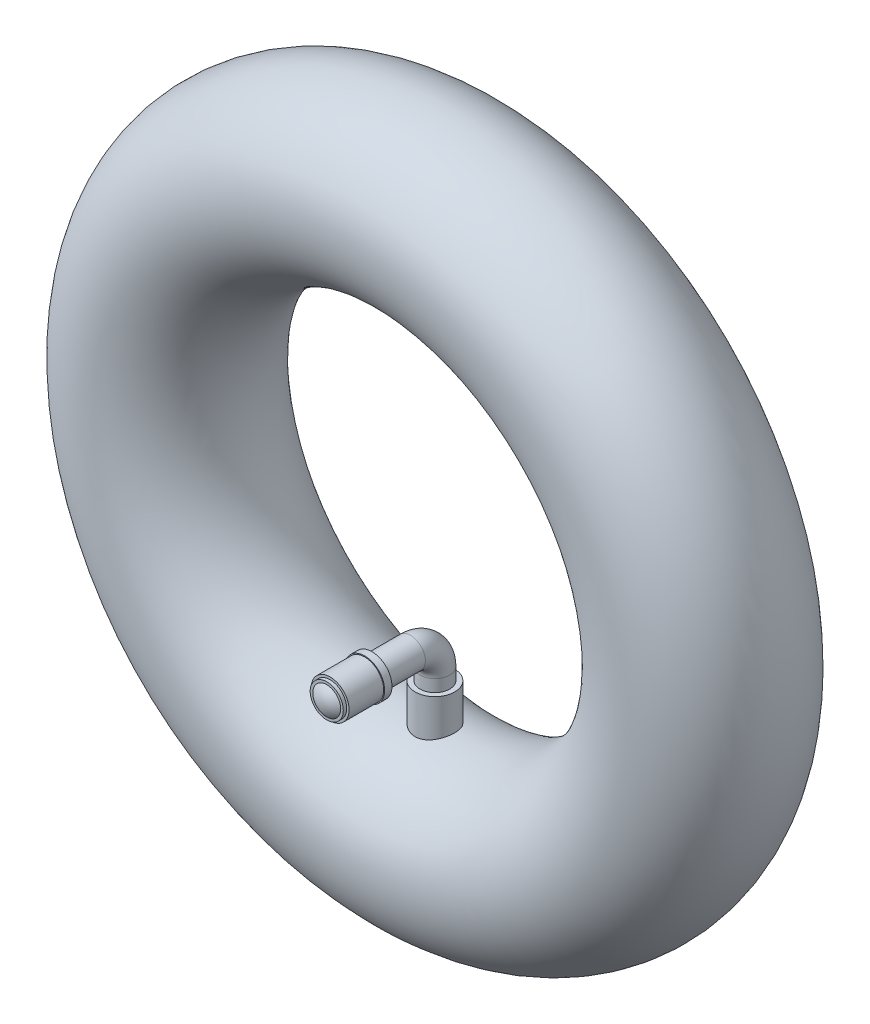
ISO-10303-21;
HEADER;
FILE_DESCRIPTION(('STEP AP214'),'2;1');
FILE_NAME('part.step','',(''),(''),'','','');
FILE_SCHEMA(('AUTOMOTIVE_DESIGN { 1 0 10303 214 1 1 1 1 }'));
ENDSEC;
DATA;
#1=APPLICATION_CONTEXT('core data for automotive mechanical design processes');
#2=APPLICATION_PROTOCOL_DEFINITION('international standard','automotive_design',2000,#1);
#3=PRODUCT_CONTEXT('',#1,'mechanical');
#4=PRODUCT('Part','Part','',(#3));
#5=PRODUCT_RELATED_PRODUCT_CATEGORY('part','',(#4));
#6=PRODUCT_DEFINITION_FORMATION('','',#4);
#7=PRODUCT_DEFINITION_CONTEXT('part definition',#1,'design');
#8=PRODUCT_DEFINITION('design','',#6,#7);
#9=PRODUCT_DEFINITION_SHAPE('','',#8);
#10=(LENGTH_UNIT() NAMED_UNIT(*) SI_UNIT(.MILLI.,.METRE.));
#11=(NAMED_UNIT(*) PLANE_ANGLE_UNIT() SI_UNIT($,.RADIAN.));
#12=(NAMED_UNIT(*) SI_UNIT($,.STERADIAN.) SOLID_ANGLE_UNIT());
#13=UNCERTAINTY_MEASURE_WITH_UNIT(LENGTH_MEASURE(1.E-05),#10,'distance_accuracy_value','');
#14=(GEOMETRIC_REPRESENTATION_CONTEXT(3) GLOBAL_UNCERTAINTY_ASSIGNED_CONTEXT((#13)) GLOBAL_UNIT_ASSIGNED_CONTEXT((#10,
#11,#12)) REPRESENTATION_CONTEXT('',''));
#15=CARTESIAN_POINT('',(0.,0.,0.));
#16=DIRECTION('',(0.,0.,1.));
#17=DIRECTION('',(1.,0.,0.));
#18=AXIS2_PLACEMENT_3D('',#15,#16,#17);
#19=CARTESIAN_POINT('',(0.,-28.575,24.1642218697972));
#20=DIRECTION('',(0.,-1.,0.));
#21=DIRECTION('',(0.,0.,-1.));
#22=AXIS2_PLACEMENT_3D('',#19,#20,#21);
#23=SPHERICAL_SURFACE('',#22,5.19943772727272);
#24=CARTESIAN_POINT('',(0.,-25.0287879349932,27.9666595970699));
#25=CARTESIAN_POINT('',(0.0995665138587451,-25.0287885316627,27.9666595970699));
#26=CARTESIAN_POINT('',(0.199151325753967,-25.0329849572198,27.9666595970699));
#27=CARTESIAN_POINT('',(0.397632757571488,-25.0497433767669,27.9666595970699));
#28=CARTESIAN_POINT('',(0.496529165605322,-25.0623078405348,27.9666595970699));
#29=CARTESIAN_POINT('',(0.693078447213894,-25.0957458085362,27.9666595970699));
#30=CARTESIAN_POINT('',(0.79072909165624,-25.1166325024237,27.9666595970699));
#31=CARTESIAN_POINT('',(0.983978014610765,-25.1665709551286,27.9666595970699));
#32=CARTESIAN_POINT('',(1.07957455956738,-25.195629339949,27.9666595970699));
#33=CARTESIAN_POINT('',(1.3618497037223,-25.2946602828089,27.9666595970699));
#34=CARTESIAN_POINT('',(1.54448885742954,-25.3765699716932,27.9666595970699));
#35=CARTESIAN_POINT('',(1.89340305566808,-25.569932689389,27.9666595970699));
#36=CARTESIAN_POINT('',(2.05967747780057,-25.6813868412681,27.9666595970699));
#37=CARTESIAN_POINT('',(2.29320300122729,-25.8681890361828,27.9666595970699));
#38=CARTESIAN_POINT('',(2.36844114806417,-25.9337759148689,27.9666595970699));
#39=CARTESIAN_POINT('',(2.51307297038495,-26.0710030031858,27.9666595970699));
#40=CARTESIAN_POINT('',(2.58247221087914,-26.1426373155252,27.9666595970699));
#41=CARTESIAN_POINT('',(2.71501968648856,-26.291531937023,27.9666595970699));
#42=CARTESIAN_POINT('',(2.77816507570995,-26.3687947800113,27.9666595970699));
#43=CARTESIAN_POINT('',(2.89772894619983,-26.5283582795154,27.9666595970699));
#44=CARTESIAN_POINT('',(2.95414586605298,-26.6106600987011,27.9666595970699));
#45=CARTESIAN_POINT('',(3.11263660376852,-26.864226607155,27.9666595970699));
#46=CARTESIAN_POINT('',(3.20409021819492,-27.0423097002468,27.96665959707));
#47=CARTESIAN_POINT('',(3.35574610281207,-27.4112060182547,27.9666595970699));
#48=CARTESIAN_POINT('',(3.41594870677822,-27.6020191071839,27.9666595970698));
#49=CARTESIAN_POINT('',(3.50348078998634,-27.9910687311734,27.9666595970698));
#50=CARTESIAN_POINT('',(3.53081009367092,-28.1893053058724,27.9666595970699));
#51=CARTESIAN_POINT('',(3.5517914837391,-28.5875527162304,27.96665959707));
#52=CARTESIAN_POINT('',(3.54544357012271,-28.7875635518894,27.9666595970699));
#53=CARTESIAN_POINT('',(3.49927621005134,-29.1836570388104,27.9666595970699));
#54=CARTESIAN_POINT('',(3.45945694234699,-29.3797397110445,27.9666595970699));
#55=CARTESIAN_POINT('',(3.34740311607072,-29.7625293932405,27.9666595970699));
#56=CARTESIAN_POINT('',(3.27516821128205,-29.9492363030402,27.9666595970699));
#57=CARTESIAN_POINT('',(3.14419886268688,-30.2180528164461,27.9666595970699));
#58=CARTESIAN_POINT('',(3.09674228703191,-30.3058271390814,27.9666595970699));
#59=CARTESIAN_POINT('',(2.99460675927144,-30.4770707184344,27.9666595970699));
#60=CARTESIAN_POINT('',(2.93992948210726,-30.5605409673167,27.9666595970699));
#61=CARTESIAN_POINT('',(2.82376117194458,-30.7225390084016,27.9666595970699));
#62=CARTESIAN_POINT('',(2.76227323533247,-30.8010690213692,27.9666595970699));
#63=CARTESIAN_POINT('',(2.63286148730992,-30.9527339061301,27.9666595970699));
#64=CARTESIAN_POINT('',(2.56493152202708,-31.0258634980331,27.9666595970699));
#65=CARTESIAN_POINT('',(2.35232738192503,-31.2361697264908,27.9666595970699));
#66=CARTESIAN_POINT('',(2.19868470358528,-31.364478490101,27.9666595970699));
#67=CARTESIAN_POINT('',(1.87202002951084,-31.5934336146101,27.96665959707));
#68=CARTESIAN_POINT('',(1.69899877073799,-31.6940810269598,27.9666595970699));
#69=CARTESIAN_POINT('',(1.4286921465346,-31.8222243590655,27.9666595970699));
#70=CARTESIAN_POINT('',(1.3366781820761,-31.8611668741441,27.9666595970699));
#71=CARTESIAN_POINT('',(1.14974644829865,-31.9311348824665,27.9666595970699));
#72=CARTESIAN_POINT('',(1.05483109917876,-31.9621667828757,27.9666595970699));
#73=CARTESIAN_POINT('',(0.862883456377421,-32.0160724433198,27.9666595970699));
#74=CARTESIAN_POINT('',(0.765854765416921,-32.0389590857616,27.9666595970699));
#75=CARTESIAN_POINT('',(0.570233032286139,-32.0764805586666,27.9666595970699));
#76=CARTESIAN_POINT('',(0.471640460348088,-32.0911178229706,27.9666595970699));
#77=CARTESIAN_POINT('',(0.310745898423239,-32.1081192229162,27.9666595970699));
#78=CARTESIAN_POINT('',(0.248701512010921,-32.1130274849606,27.9666595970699));
#79=CARTESIAN_POINT('',(0.124440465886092,-32.1195740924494,27.9666595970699));
#80=CARTESIAN_POINT('',(0.0622238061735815,-32.1212124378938,27.9666595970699));
#81=CARTESIAN_POINT('',(-0.0995665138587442,-32.1212114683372,27.9666595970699));
#82=CARTESIAN_POINT('',(-0.199151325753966,-32.1170150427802,27.9666595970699));
#83=CARTESIAN_POINT('',(-0.397632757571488,-32.1002566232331,27.9666595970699));
#84=CARTESIAN_POINT('',(-0.496529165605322,-32.0876921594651,27.9666595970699));
#85=CARTESIAN_POINT('',(-0.693078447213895,-32.0542541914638,27.9666595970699));
#86=CARTESIAN_POINT('',(-0.790729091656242,-32.0333674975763,27.9666595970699));
#87=CARTESIAN_POINT('',(-0.983978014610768,-31.9834290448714,27.9666595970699));
#88=CARTESIAN_POINT('',(-1.07957455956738,-31.9543706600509,27.9666595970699));
#89=CARTESIAN_POINT('',(-1.3618497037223,-31.855339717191,27.9666595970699));
#90=CARTESIAN_POINT('',(-1.54448885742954,-31.7734300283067,27.9666595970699));
#91=CARTESIAN_POINT('',(-1.89340305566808,-31.580067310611,27.9666595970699));
#92=CARTESIAN_POINT('',(-2.05967747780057,-31.4686131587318,27.9666595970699));
#93=CARTESIAN_POINT('',(-2.29320300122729,-31.2818109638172,27.9666595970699));
#94=CARTESIAN_POINT('',(-2.36844114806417,-31.2162240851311,27.9666595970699));
#95=CARTESIAN_POINT('',(-2.51307297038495,-31.0789969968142,27.9666595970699));
#96=CARTESIAN_POINT('',(-2.58247221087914,-31.0073626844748,27.9666595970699));
#97=CARTESIAN_POINT('',(-2.71501968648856,-30.858468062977,27.9666595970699));
#98=CARTESIAN_POINT('',(-2.77816507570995,-30.7812052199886,27.9666595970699));
#99=CARTESIAN_POINT('',(-2.89772894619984,-30.6216417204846,27.9666595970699));
#100=CARTESIAN_POINT('',(-2.95414586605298,-30.5393399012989,27.9666595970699));
#101=CARTESIAN_POINT('',(-3.11263660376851,-30.285773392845,27.9666595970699));
#102=CARTESIAN_POINT('',(-3.20409021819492,-30.1076902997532,27.96665959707));
#103=CARTESIAN_POINT('',(-3.35574610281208,-29.7387939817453,27.9666595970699));
#104=CARTESIAN_POINT('',(-3.41594870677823,-29.5479808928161,27.9666595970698));
#105=CARTESIAN_POINT('',(-3.50348078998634,-29.1589312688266,27.9666595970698));
#106=CARTESIAN_POINT('',(-3.53081009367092,-28.9606946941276,27.9666595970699));
#107=CARTESIAN_POINT('',(-3.5517914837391,-28.5624472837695,27.96665959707));
#108=CARTESIAN_POINT('',(-3.54544357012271,-28.3624364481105,27.9666595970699));
#109=CARTESIAN_POINT('',(-3.49927621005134,-27.9663429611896,27.9666595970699));
#110=CARTESIAN_POINT('',(-3.45945694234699,-27.7702602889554,27.9666595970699));
#111=CARTESIAN_POINT('',(-3.34740311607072,-27.3874706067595,27.9666595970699));
#112=CARTESIAN_POINT('',(-3.27516821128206,-27.2007636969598,27.9666595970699));
#113=CARTESIAN_POINT('',(-3.14419886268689,-26.9319471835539,27.9666595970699));
#114=CARTESIAN_POINT('',(-3.09674228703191,-26.8441728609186,27.9666595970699));
#115=CARTESIAN_POINT('',(-2.99460675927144,-26.6729292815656,27.9666595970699));
#116=CARTESIAN_POINT('',(-2.93992948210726,-26.5894590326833,27.9666595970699));
#117=CARTESIAN_POINT('',(-2.82376117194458,-26.4274609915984,27.9666595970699));
#118=CARTESIAN_POINT('',(-2.76227323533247,-26.3489309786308,27.9666595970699));
#119=CARTESIAN_POINT('',(-2.63286148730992,-26.1972660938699,27.9666595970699));
#120=CARTESIAN_POINT('',(-2.56493152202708,-26.1241365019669,27.9666595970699));
#121=CARTESIAN_POINT('',(-2.35232738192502,-25.9138302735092,27.9666595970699));
#122=CARTESIAN_POINT('',(-2.19868470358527,-25.7855215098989,27.9666595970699));
#123=CARTESIAN_POINT('',(-1.87202002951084,-25.5565663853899,27.96665959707));
#124=CARTESIAN_POINT('',(-1.69899877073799,-25.4559189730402,27.9666595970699));
#125=CARTESIAN_POINT('',(-1.4286921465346,-25.3277756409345,27.9666595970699));
#126=CARTESIAN_POINT('',(-1.33667818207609,-25.2888331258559,27.9666595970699));
#127=CARTESIAN_POINT('',(-1.14974644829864,-25.2188651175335,27.9666595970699));
#128=CARTESIAN_POINT('',(-1.05483109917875,-25.1878332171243,27.9666595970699));
#129=CARTESIAN_POINT('',(-0.862883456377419,-25.1339275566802,27.9666595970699));
#130=CARTESIAN_POINT('',(-0.765854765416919,-25.1110409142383,27.9666595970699));
#131=CARTESIAN_POINT('',(-0.570233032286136,-25.0735194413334,27.9666595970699));
#132=CARTESIAN_POINT('',(-0.471640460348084,-25.0588821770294,27.9666595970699));
#133=CARTESIAN_POINT('',(-0.310745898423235,-25.0418807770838,27.9666595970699));
#134=CARTESIAN_POINT('',(-0.248701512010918,-25.0369725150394,27.9666595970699));
#135=CARTESIAN_POINT('',(-0.12444046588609,-25.0304259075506,27.9666595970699));
#136=CARTESIAN_POINT('',(-0.06222380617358,-25.0287875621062,27.9666595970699));
#137=CARTESIAN_POINT('',(0.,-25.0287879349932,27.9666595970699));
#138=B_SPLINE_CURVE_WITH_KNOTS('',3,(#24,#25,#26,#27,#28,#29,#30,#31,#32,#33,#34,#35,#36,#37,
#38,#39,#40,#41,#42,#43,#44,#45,#46,#47,#48,#49,#50,#51,#52,#53,#54,#55,#56,#57,#58,#59,#60,#61,
#62,#63,#64,#65,#66,#67,#68,#69,#70,#71,#72,#73,#74,#75,#76,#77,#78,#79,#80,#81,#82,#83,#84,#85,
#86,#87,#88,#89,#90,#91,#92,#93,#94,#95,#96,#97,#98,#99,#100,#101,#102,#103,#104,#105,#106,#107,
#108,#109,#110,#111,#112,#113,#114,#115,#116,#117,#118,#119,#120,#121,#122,#123,#124,#125,#126,
#127,#128,#129,#130,#131,#132,#133,#134,#135,#136,#137),.UNSPECIFIED.,.T.,.F.,(4,2,2,2,2,2,2,2,
2,2,2,2,2,2,2,2,2,2,2,2,2,2,2,2,2,2,2,2,2,2,2,2,2,2,2,2,2,2,2,2,2,2,2,2,2,2,2,2,2,2,2,2,2,2,2,2,
4),(0.,0.298642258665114,0.597372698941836,0.896578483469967,1.19602758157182,1.79349833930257,
2.39099181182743,2.69013001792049,2.98897980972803,3.28796497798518,3.5870193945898,
4.1845047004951,4.78198362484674,5.37946573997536,5.97694785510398,6.57442677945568,
7.17191208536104,7.47096650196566,7.76995167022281,8.06880146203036,8.36793966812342,
8.96543314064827,9.56290389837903,9.86235299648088,10.161558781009,10.4602892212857,
10.7589314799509,10.9455670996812,11.1322027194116,11.4308449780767,11.7295754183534,
12.0287812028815,12.3282303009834,12.9257010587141,13.523194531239,13.8223327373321,
14.1211825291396,14.4201676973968,14.7192221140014,15.3167074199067,15.9141863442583,
16.5116684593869,17.1091505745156,17.7066294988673,18.3041148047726,18.6031692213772,
18.9021543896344,19.2010041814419,19.500142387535,20.0976358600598,20.6951066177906,
20.9945557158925,21.2937615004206,21.5924919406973,21.8911341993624,22.0777698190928,
22.2644054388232),.UNSPECIFIED.);
#139=CARTESIAN_POINT('',(0.,-25.0287879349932,27.9666595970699));
#140=VERTEX_POINT('',#139);
#141=EDGE_CURVE('P0_E17',#140,#140,#138,.T.);
#142=ORIENTED_EDGE('',*,*,#141,.T.);
#143=EDGE_LOOP('',(#142));
#144=FACE_BOUND('',#143,.T.);
#145=ADVANCED_FACE('P0_F13',(#144),#23,.F.);
#146=CARTESIAN_POINT('',(0.,-24.511,27.9666595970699));
#147=DIRECTION('',(0.,0.,1.));
#148=DIRECTION('',(1.,0.,0.));
#149=AXIS2_PLACEMENT_3D('',#146,#147,#148);
#150=PLANE('',#149);
#151=ORIENTED_EDGE('',*,*,#141,.F.);
#152=EDGE_LOOP('',(#151));
#153=FACE_BOUND('',#152,.T.);
#154=CARTESIAN_POINT('',(0.,-28.575,27.9666595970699));
#155=DIRECTION('',(0.,0.,1.));
#156=DIRECTION('',(1.,0.,0.));
#157=AXIS2_PLACEMENT_3D('',#154,#155,#156);
#158=CIRCLE('',#157,4.064);
#159=CARTESIAN_POINT('',(4.064,-28.575,27.9666595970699));
#160=VERTEX_POINT('',#159);
#161=EDGE_CURVE('P0_E239',#160,#160,#158,.F.);
#162=ORIENTED_EDGE('',*,*,#161,.T.);
#163=EDGE_LOOP('',(#162));
#164=FACE_BOUND('',#163,.T.);
#165=ADVANCED_FACE('P0_F213',(#153,#164),#150,.F.);
#166=CARTESIAN_POINT('',(0.,-28.575,38.228344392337));
#167=DIRECTION('',(0.,0.,1.));
#168=DIRECTION('',(1.,0.,0.));
#169=AXIS2_PLACEMENT_3D('',#166,#167,#168);
#170=CYLINDRICAL_SURFACE('',#169,4.064);
#171=CARTESIAN_POINT('',(0.,-28.575,27.0776595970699));
#172=DIRECTION('',(0.,0.,1.));
#173=DIRECTION('',(1.,0.,0.));
#174=AXIS2_PLACEMENT_3D('',#171,#172,#173);
#175=CIRCLE('',#174,4.064);
#176=CARTESIAN_POINT('',(4.064,-28.575,27.0776595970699));
#177=VERTEX_POINT('',#176);
#178=EDGE_CURVE('P0_E241',#177,#177,#175,.F.);
#179=ORIENTED_EDGE('',*,*,#178,.T.);
#180=EDGE_LOOP('',(#179));
#181=FACE_BOUND('',#180,.T.);
#182=ORIENTED_EDGE('',*,*,#161,.F.);
#183=EDGE_LOOP('',(#182));
#184=FACE_BOUND('',#183,.T.);
#185=ADVANCED_FACE('P0_F203',(#181,#184),#170,.F.);
#186=CARTESIAN_POINT('',(0.,-24.511,27.0776595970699));
#187=DIRECTION('',(0.,0.,1.));
#188=DIRECTION('',(1.,0.,0.));
#189=AXIS2_PLACEMENT_3D('',#186,#187,#188);
#190=PLANE('',#189);
#191=ORIENTED_EDGE('',*,*,#178,.F.);
#192=EDGE_LOOP('',(#191));
#193=FACE_BOUND('',#192,.T.);
#194=CARTESIAN_POINT('',(0.,-28.575,27.0776595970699));
#195=DIRECTION('',(0.,0.,1.));
#196=DIRECTION('',(1.,0.,0.));
#197=AXIS2_PLACEMENT_3D('',#194,#195,#196);
#198=CIRCLE('',#197,4.699);
#199=CARTESIAN_POINT('',(4.699,-28.575,27.0776595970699));
#200=VERTEX_POINT('',#199);
#201=EDGE_CURVE('P0_E245',#200,#200,#198,.F.);
#202=ORIENTED_EDGE('',*,*,#201,.T.);
#203=EDGE_LOOP('',(#202));
#204=FACE_BOUND('',#203,.T.);
#205=ADVANCED_FACE('P0_F193',(#193,#204),#190,.F.);
#206=CARTESIAN_POINT('',(0.,-28.575,38.228344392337));
#207=DIRECTION('',(0.,0.,1.));
#208=DIRECTION('',(1.,0.,0.));
#209=AXIS2_PLACEMENT_3D('',#206,#207,#208);
#210=CYLINDRICAL_SURFACE('',#209,4.699);
#211=CARTESIAN_POINT('',(0.,-28.575,18.0606595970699));
#212=DIRECTION('',(0.,0.,1.));
#213=DIRECTION('',(1.,0.,0.));
#214=AXIS2_PLACEMENT_3D('',#211,#212,#213);
#215=CIRCLE('',#214,4.699);
#216=CARTESIAN_POINT('',(4.699,-28.575,18.0606595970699));
#217=VERTEX_POINT('',#216);
#218=EDGE_CURVE('P0_E250',#217,#217,#215,.F.);
#219=ORIENTED_EDGE('',*,*,#218,.T.);
#220=EDGE_LOOP('',(#219));
#221=FACE_BOUND('',#220,.T.);
#222=ORIENTED_EDGE('',*,*,#201,.F.);
#223=EDGE_LOOP('',(#222));
#224=FACE_BOUND('',#223,.T.);
#225=ADVANCED_FACE('P0_F183',(#221,#224),#210,.F.);
#226=CARTESIAN_POINT('',(0.,-23.622,18.0606595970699));
#227=DIRECTION('',(0.,0.,1.));
#228=DIRECTION('',(1.,0.,0.));
#229=AXIS2_PLACEMENT_3D('',#226,#227,#228);
#230=PLANE('',#229);
#231=ORIENTED_EDGE('',*,*,#218,.F.);
#232=EDGE_LOOP('',(#231));
#233=FACE_BOUND('',#232,.T.);
#234=CARTESIAN_POINT('',(0.,-28.575,18.0606595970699));
#235=DIRECTION('',(0.,0.,1.));
#236=DIRECTION('',(1.,0.,0.));
#237=AXIS2_PLACEMENT_3D('',#234,#235,#236);
#238=CIRCLE('',#237,4.953);
#239=CARTESIAN_POINT('',(4.953,-28.575,18.0606595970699));
#240=VERTEX_POINT('',#239);
#241=EDGE_CURVE('P0_E253',#240,#240,#238,.F.);
#242=ORIENTED_EDGE('',*,*,#241,.T.);
#243=EDGE_LOOP('',(#242));
#244=FACE_BOUND('',#243,.T.);
#245=ADVANCED_FACE('P0_F173',(#233,#244),#230,.F.);
#246=CARTESIAN_POINT('',(0.,-28.575,38.228344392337));
#247=DIRECTION('',(0.,0.,1.));
#248=DIRECTION('',(1.,0.,0.));
#249=AXIS2_PLACEMENT_3D('',#246,#247,#248);
#250=CYLINDRICAL_SURFACE('',#249,4.953);
#251=CARTESIAN_POINT('',(0.,-28.575,16.6636595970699));
#252=DIRECTION('',(0.,0.,1.));
#253=DIRECTION('',(1.,0.,0.));
#254=AXIS2_PLACEMENT_3D('',#251,#252,#253);
#255=CIRCLE('',#254,4.953);
#256=CARTESIAN_POINT('',(4.953,-28.575,16.6636595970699));
#257=VERTEX_POINT('',#256);
#258=EDGE_CURVE('P0_E256',#257,#257,#255,.F.);
#259=ORIENTED_EDGE('',*,*,#258,.T.);
#260=EDGE_LOOP('',(#259));
#261=FACE_BOUND('',#260,.T.);
#262=ORIENTED_EDGE('',*,*,#241,.F.);
#263=EDGE_LOOP('',(#262));
#264=FACE_BOUND('',#263,.T.);
#265=ADVANCED_FACE('P0_F163',(#261,#264),#250,.F.);
#266=CARTESIAN_POINT('',(0.,-24.638,16.6636595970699));
#267=DIRECTION('',(0.,0.,-1.));
#268=DIRECTION('',(-1.,0.,0.));
#269=AXIS2_PLACEMENT_3D('',#266,#267,#268);
#270=PLANE('',#269);
#271=ORIENTED_EDGE('',*,*,#258,.F.);
#272=EDGE_LOOP('',(#271));
#273=FACE_BOUND('',#272,.T.);
#274=CARTESIAN_POINT('',(0.,-28.575,16.6636595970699));
#275=DIRECTION('',(0.,0.,1.));
#276=DIRECTION('',(1.,0.,0.));
#277=AXIS2_PLACEMENT_3D('',#274,#275,#276);
#278=CIRCLE('',#277,3.937);
#279=CARTESIAN_POINT('',(3.937,-28.575,16.6636595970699));
#280=VERTEX_POINT('',#279);
#281=EDGE_CURVE('P0_E258',#280,#280,#278,.F.);
#282=ORIENTED_EDGE('',*,*,#281,.T.);
#283=EDGE_LOOP('',(#282));
#284=FACE_BOUND('',#283,.T.);
#285=ADVANCED_FACE('P0_F154',(#273,#284),#270,.F.);
#286=CARTESIAN_POINT('',(0.,-28.575,38.228344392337));
#287=DIRECTION('',(0.,0.,1.));
#288=DIRECTION('',(1.,0.,0.));
#289=AXIS2_PLACEMENT_3D('',#286,#287,#288);
#290=CYLINDRICAL_SURFACE('',#289,3.937);
#291=CARTESIAN_POINT('',(0.,-28.575,16.4096595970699));
#292=DIRECTION('',(0.,0.,1.));
#293=DIRECTION('',(1.,0.,0.));
#294=AXIS2_PLACEMENT_3D('',#291,#292,#293);
#295=CIRCLE('',#294,3.937);
#296=CARTESIAN_POINT('',(3.937,-28.575,16.4096595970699));
#297=VERTEX_POINT('',#296);
#298=EDGE_CURVE('P0_E54',#297,#297,#295,.F.);
#299=ORIENTED_EDGE('',*,*,#298,.T.);
#300=EDGE_LOOP('',(#299));
#301=FACE_BOUND('',#300,.T.);
#302=ORIENTED_EDGE('',*,*,#281,.F.);
#303=EDGE_LOOP('',(#302));
#304=FACE_BOUND('',#303,.T.);
#305=ADVANCED_FACE('P0_F144',(#301,#304),#290,.F.);
#306=CARTESIAN_POINT('',(0.,-28.575,24.1642218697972));
#307=DIRECTION('',(0.,1.,0.));
#308=DIRECTION('',(0.,0.,-1.));
#309=AXIS2_PLACEMENT_3D('',#306,#307,#308);
#310=SPHERICAL_SURFACE('',#309,5.45343772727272);
#311=CARTESIAN_POINT('',(0.,-24.9301,28.2206595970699));
#312=CARTESIAN_POINT('',(-0.102337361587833,-24.9301006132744,28.2206595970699));
#313=CARTESIAN_POINT('',(-0.204693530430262,-24.9344138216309,28.2206595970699));
#314=CARTESIAN_POINT('',(-0.408698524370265,-24.9516386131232,28.2206595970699));
#315=CARTESIAN_POINT('',(-0.510347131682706,-24.9645527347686,28.2206595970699));
#316=CARTESIAN_POINT('',(-0.712366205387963,-24.9989212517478,28.2206595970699));
#317=CARTESIAN_POINT('',(-0.812734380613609,-25.0203892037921,28.2206595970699));
#318=CARTESIAN_POINT('',(-1.01136124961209,-25.0717173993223,28.2206595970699));
#319=CARTESIAN_POINT('',(-1.10961816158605,-25.101584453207,28.2206595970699));
#320=CARTESIAN_POINT('',(-1.3997487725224,-25.2033713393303,28.2206595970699));
#321=CARTESIAN_POINT('',(-1.58747061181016,-25.2875605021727,28.2206595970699));
#322=CARTESIAN_POINT('',(-1.94609478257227,-25.486304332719,28.2206595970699));
#323=CARTESIAN_POINT('',(-2.11699647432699,-25.6008601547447,28.2206595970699));
#324=CARTESIAN_POINT('',(-2.35702080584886,-25.7928608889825,28.2206595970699));
#325=CARTESIAN_POINT('',(-2.43435276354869,-25.8602729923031,28.2206595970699));
#326=CARTESIAN_POINT('',(-2.58300956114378,-26.0013189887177,28.2206595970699));
#327=CARTESIAN_POINT('',(-2.65434012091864,-26.0749468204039,28.2206595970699));
#328=CARTESIAN_POINT('',(-2.7905762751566,-26.2279850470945,28.2206595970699));
#329=CARTESIAN_POINT('',(-2.85547894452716,-26.3073980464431,28.2206595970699));
#330=CARTESIAN_POINT('',(-2.97837017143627,-26.4714020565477,28.2206595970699));
#331=CARTESIAN_POINT('',(-3.03635712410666,-26.5559942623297,28.2206595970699));
#332=CARTESIAN_POINT('',(-3.19925851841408,-26.8166173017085,28.2206595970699));
#333=CARTESIAN_POINT('',(-3.29325720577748,-26.9996562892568,28.2206595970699));
#334=CARTESIAN_POINT('',(-3.44913353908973,-27.37881866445,28.2206595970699));
#335=CARTESIAN_POINT('',(-3.51101152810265,-27.5749419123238,28.2206595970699));
#336=CARTESIAN_POINT('',(-3.60097955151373,-27.9748184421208,28.2206595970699));
#337=CARTESIAN_POINT('',(-3.62906940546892,-28.178571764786,28.22065959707));
#338=CARTESIAN_POINT('',(-3.65063468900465,-28.5879020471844,28.2206595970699));
#339=CARTESIAN_POINT('',(-3.64411011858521,-28.7934790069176,28.2206595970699));
#340=CARTESIAN_POINT('',(-3.59665796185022,-29.200595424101,28.2206595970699));
#341=CARTESIAN_POINT('',(-3.55573055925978,-29.402134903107,28.2206595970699));
#342=CARTESIAN_POINT('',(-3.44055837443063,-29.7955772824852,28.2206595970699));
#343=CARTESIAN_POINT('',(-3.36631323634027,-29.987480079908,28.2206595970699));
#344=CARTESIAN_POINT('',(-3.23169912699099,-30.2637775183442,28.2206595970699));
#345=CARTESIAN_POINT('',(-3.18292187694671,-30.3539945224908,28.2206595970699));
#346=CARTESIAN_POINT('',(-3.07794400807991,-30.530003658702,28.2206595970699));
#347=CARTESIAN_POINT('',(-3.02174511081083,-30.6157968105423,28.2206595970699));
#348=CARTESIAN_POINT('',(-2.90234393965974,-30.7823031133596,28.2206595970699));
#349=CARTESIAN_POINT('',(-2.8391448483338,-30.8630185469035,28.2206595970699));
#350=CARTESIAN_POINT('',(-2.70613168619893,-31.0189041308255,28.2206595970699));
#351=CARTESIAN_POINT('',(-2.63631129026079,-31.0940688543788,28.2206595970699));
#352=CARTESIAN_POINT('',(-2.41779056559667,-31.3102277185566,28.2206595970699));
#353=CARTESIAN_POINT('',(-2.25987214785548,-31.4421072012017,28.2206595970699));
#354=CARTESIAN_POINT('',(-1.92411668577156,-31.6774339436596,28.22065959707));
#355=CARTESIAN_POINT('',(-1.74628039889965,-31.7808822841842,28.2206595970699));
#356=CARTESIAN_POINT('',(-1.46845138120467,-31.9125917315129,28.2206595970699));
#357=CARTESIAN_POINT('',(-1.37387674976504,-31.95261798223,28.2206595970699));
#358=CARTESIAN_POINT('',(-1.18174287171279,-32.024533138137,28.2206595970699));
#359=CARTESIAN_POINT('',(-1.08418611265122,-32.056428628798,28.2206595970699));
#360=CARTESIAN_POINT('',(-0.886896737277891,-32.1118344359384,28.2206595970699));
#361=CARTESIAN_POINT('',(-0.787167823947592,-32.1353579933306,28.2206595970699));
#362=CARTESIAN_POINT('',(-0.586102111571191,-32.1739236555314,28.2206595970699));
#363=CARTESIAN_POINT('',(-0.484765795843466,-32.1889682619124,28.2206595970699));
#364=CARTESIAN_POINT('',(-0.319393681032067,-32.2064427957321,28.2206595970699));
#365=CARTESIAN_POINT('',(-0.255622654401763,-32.2114876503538,28.2206595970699));
#366=CARTESIAN_POINT('',(-0.127903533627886,-32.2182164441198,28.2206595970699));
#367=CARTESIAN_POINT('',(-0.0639554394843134,-32.219900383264,28.2206595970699));
#368=CARTESIAN_POINT('',(0.102337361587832,-32.2198993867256,28.2206595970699));
#369=CARTESIAN_POINT('',(0.204693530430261,-32.2155861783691,28.2206595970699));
#370=CARTESIAN_POINT('',(0.408698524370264,-32.1983613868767,28.2206595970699));
#371=CARTESIAN_POINT('',(0.510347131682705,-32.1854472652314,28.2206595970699));
#372=CARTESIAN_POINT('',(0.712366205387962,-32.1510787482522,28.2206595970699));
#373=CARTESIAN_POINT('',(0.812734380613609,-32.1296107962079,28.2206595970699));
#374=CARTESIAN_POINT('',(1.01136124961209,-32.0782826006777,28.2206595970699));
#375=CARTESIAN_POINT('',(1.10961816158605,-32.048415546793,28.2206595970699));
#376=CARTESIAN_POINT('',(1.3997487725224,-31.9466286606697,28.2206595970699));
#377=CARTESIAN_POINT('',(1.58747061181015,-31.8624394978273,28.2206595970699));
#378=CARTESIAN_POINT('',(1.94609478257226,-31.663695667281,28.2206595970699));
#379=CARTESIAN_POINT('',(2.11699647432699,-31.5491398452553,28.2206595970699));
#380=CARTESIAN_POINT('',(2.35702080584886,-31.3571391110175,28.2206595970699));
#381=CARTESIAN_POINT('',(2.43435276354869,-31.2897270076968,28.2206595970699));
#382=CARTESIAN_POINT('',(2.58300956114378,-31.1486810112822,28.2206595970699));
#383=CARTESIAN_POINT('',(2.65434012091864,-31.0750531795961,28.2206595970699));
#384=CARTESIAN_POINT('',(2.7905762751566,-30.9220149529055,28.2206595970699));
#385=CARTESIAN_POINT('',(2.85547894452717,-30.8426019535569,28.2206595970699));
#386=CARTESIAN_POINT('',(2.97837017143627,-30.6785979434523,28.2206595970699));
#387=CARTESIAN_POINT('',(3.03635712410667,-30.5940057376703,28.2206595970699));
#388=CARTESIAN_POINT('',(3.19925851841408,-30.3333826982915,28.2206595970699));
#389=CARTESIAN_POINT('',(3.29325720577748,-30.1503437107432,28.2206595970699));
#390=CARTESIAN_POINT('',(3.44913353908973,-29.77118133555,28.2206595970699));
#391=CARTESIAN_POINT('',(3.51101152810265,-29.5750580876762,28.2206595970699));
#392=CARTESIAN_POINT('',(3.60097955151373,-29.1751815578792,28.2206595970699));
#393=CARTESIAN_POINT('',(3.62906940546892,-28.971428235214,28.22065959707));
#394=CARTESIAN_POINT('',(3.65063468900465,-28.5620979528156,28.2206595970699));
#395=CARTESIAN_POINT('',(3.64411011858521,-28.3565209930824,28.2206595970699));
#396=CARTESIAN_POINT('',(3.59665796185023,-27.949404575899,28.2206595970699));
#397=CARTESIAN_POINT('',(3.55573055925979,-27.747865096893,28.2206595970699));
#398=CARTESIAN_POINT('',(3.44055837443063,-27.3544227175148,28.2206595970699));
#399=CARTESIAN_POINT('',(3.36631323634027,-27.162519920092,28.2206595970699));
#400=CARTESIAN_POINT('',(3.23169912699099,-26.8862224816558,28.2206595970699));
#401=CARTESIAN_POINT('',(3.18292187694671,-26.7960054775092,28.2206595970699));
#402=CARTESIAN_POINT('',(3.07794400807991,-26.619996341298,28.2206595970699));
#403=CARTESIAN_POINT('',(3.02174511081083,-26.5342031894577,28.2206595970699));
#404=CARTESIAN_POINT('',(2.90234393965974,-26.3676968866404,28.2206595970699));
#405=CARTESIAN_POINT('',(2.83914484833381,-26.2869814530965,28.2206595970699));
#406=CARTESIAN_POINT('',(2.70613168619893,-26.1310958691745,28.2206595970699));
#407=CARTESIAN_POINT('',(2.63631129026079,-26.0559311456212,28.2206595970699));
#408=CARTESIAN_POINT('',(2.41779056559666,-25.8397722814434,28.2206595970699));
#409=CARTESIAN_POINT('',(2.25987214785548,-25.7078927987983,28.2206595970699));
#410=CARTESIAN_POINT('',(1.92411668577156,-25.4725660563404,28.22065959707));
#411=CARTESIAN_POINT('',(1.74628039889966,-25.3691177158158,28.2206595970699));
#412=CARTESIAN_POINT('',(1.46845138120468,-25.2374082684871,28.2206595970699));
#413=CARTESIAN_POINT('',(1.37387674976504,-25.19738201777,28.2206595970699));
#414=CARTESIAN_POINT('',(1.18174287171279,-25.125466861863,28.2206595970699));
#415=CARTESIAN_POINT('',(1.08418611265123,-25.093571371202,28.2206595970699));
#416=CARTESIAN_POINT('',(0.886896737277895,-25.0381655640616,28.2206595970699));
#417=CARTESIAN_POINT('',(0.787167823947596,-25.0146420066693,28.2206595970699));
#418=CARTESIAN_POINT('',(0.586102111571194,-24.9760763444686,28.2206595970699));
#419=CARTESIAN_POINT('',(0.484765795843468,-24.9610317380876,28.2206595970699));
#420=CARTESIAN_POINT('',(0.319393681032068,-24.9435572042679,28.2206595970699));
#421=CARTESIAN_POINT('',(0.255622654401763,-24.9385123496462,28.2206595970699));
#422=CARTESIAN_POINT('',(0.127903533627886,-24.9317835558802,28.2206595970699));
#423=CARTESIAN_POINT('',(0.0639554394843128,-24.9300996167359,28.2206595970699));
#424=CARTESIAN_POINT('',(0.,-24.9301,28.2206595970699));
#425=B_SPLINE_CURVE_WITH_KNOTS('',3,(#311,#312,#313,#314,#315,#316,#317,#318,#319,#320,#321,
#322,#323,#324,#325,#326,#327,#328,#329,#330,#331,#332,#333,#334,#335,#336,#337,#338,#339,#340,
#341,#342,#343,#344,#345,#346,#347,#348,#349,#350,#351,#352,#353,#354,#355,#356,#357,#358,#359,
#360,#361,#362,#363,#364,#365,#366,#367,#368,#369,#370,#371,#372,#373,#374,#375,#376,#377,#378,
#379,#380,#381,#382,#383,#384,#385,#386,#387,#388,#389,#390,#391,#392,#393,#394,#395,#396,#397,
#398,#399,#400,#401,#402,#403,#404,#405,#406,#407,#408,#409,#410,#411,#412,#413,#414,#415,#416,
#417,#418,#419,#420,#421,#422,#423,#424),.UNSPECIFIED.,.T.,.F.,(4,2,2,2,2,2,2,2,2,2,2,2,2,2,2,2,
2,2,2,2,2,2,2,2,2,2,2,2,2,2,2,2,2,2,2,2,2,2,2,2,2,2,2,2,2,2,2,2,2,2,2,2,2,2,2,2,4),(0.,
0.306953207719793,0.613997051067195,0.921529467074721,1.22931196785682,1.84340980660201,
2.45753099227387,2.76499394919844,3.07216046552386,3.37946612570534,3.68684296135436,
4.30095575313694,4.91506198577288,5.52917149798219,6.1432810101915,6.75738724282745,
7.37150003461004,7.67887687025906,7.98618253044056,8.29334904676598,8.60081200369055,
9.21493318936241,9.82903102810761,10.1368135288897,10.4443459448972,10.7513897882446,
11.0583429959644,11.2501725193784,11.4420020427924,11.7489552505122,12.0559990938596,
12.3635315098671,12.6713140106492,13.2854118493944,13.8995330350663,14.2069959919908,
14.5141625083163,14.8214681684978,15.1288450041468,15.7429577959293,16.3570640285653,
16.9711735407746,17.5852830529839,18.1993892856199,18.8135020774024,19.1208789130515,
19.428184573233,19.7353510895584,20.042814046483,20.6569352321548,21.2710330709,
21.5788155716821,21.8863479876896,22.193391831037,22.5003450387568,22.6921745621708,
22.8840040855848),.UNSPECIFIED.);
#426=CARTESIAN_POINT('',(0.,-24.9301,28.2206595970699));
#427=VERTEX_POINT('',#426);
#428=EDGE_CURVE('P0_E47',#427,#427,#425,.T.);
#429=ORIENTED_EDGE('',*,*,#428,.T.);
#430=EDGE_LOOP('',(#429));
#431=FACE_BOUND('',#430,.T.);
#432=ADVANCED_FACE('P0_F56',(#431),#310,.T.);
#433=CARTESIAN_POINT('',(0.,-24.638,16.4096595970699));
#434=DIRECTION('',(0.,0.,1.));
#435=DIRECTION('',(1.,0.,0.));
#436=AXIS2_PLACEMENT_3D('',#433,#434,#435);
#437=PLANE('',#436);
#438=ORIENTED_EDGE('',*,*,#298,.F.);
#439=EDGE_LOOP('',(#438));
#440=FACE_BOUND('',#439,.T.);
#441=CARTESIAN_POINT('',(0.,-28.575,16.4096595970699));
#442=DIRECTION('',(0.,0.,1.));
#443=DIRECTION('',(1.,0.,0.));
#444=AXIS2_PLACEMENT_3D('',#441,#442,#443);
#445=CIRCLE('',#444,5.207);
#446=CARTESIAN_POINT('',(5.207,-28.575,16.4096595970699));
#447=VERTEX_POINT('',#446);
#448=EDGE_CURVE('P0_E44',#447,#447,#445,.T.);
#449=ORIENTED_EDGE('',*,*,#448,.F.);
#450=EDGE_LOOP('',(#449));
#451=FACE_BOUND('',#450,.T.);
#452=ADVANCED_FACE('P0_F65',(#440,#451),#437,.F.);
#453=CARTESIAN_POINT('',(0.,-24.257,28.2206595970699));
#454=DIRECTION('',(0.,0.,-1.));
#455=DIRECTION('',(-1.,0.,0.));
#456=AXIS2_PLACEMENT_3D('',#453,#454,#455);
#457=PLANE('',#456);
#458=CARTESIAN_POINT('',(0.,-28.575,28.2206595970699));
#459=DIRECTION('',(0.,0.,1.));
#460=DIRECTION('',(1.,0.,0.));
#461=AXIS2_PLACEMENT_3D('',#458,#459,#460);
#462=CIRCLE('',#461,4.318);
#463=CARTESIAN_POINT('',(4.318,-28.575,28.2206595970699));
#464=VERTEX_POINT('',#463);
#465=EDGE_CURVE('P0_E41',#464,#464,#462,.F.);
#466=ORIENTED_EDGE('',*,*,#465,.F.);
#467=EDGE_LOOP('',(#466));
#468=FACE_BOUND('',#467,.T.);
#469=ORIENTED_EDGE('',*,*,#428,.F.);
#470=EDGE_LOOP('',(#469));
#471=FACE_BOUND('',#470,.T.);
#472=ADVANCED_FACE('P0_F60',(#468,#471),#457,.F.);
#473=CARTESIAN_POINT('',(0.,-28.575,38.228344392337));
#474=DIRECTION('',(0.,0.,1.));
#475=DIRECTION('',(1.,0.,0.));
#476=AXIS2_PLACEMENT_3D('',#473,#474,#475);
#477=CYLINDRICAL_SURFACE('',#476,5.207);
#478=CARTESIAN_POINT('',(0.,-28.575,18.3146595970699));
#479=DIRECTION('',(0.,0.,1.));
#480=DIRECTION('',(1.,0.,0.));
#481=AXIS2_PLACEMENT_3D('',#478,#479,#480);
#482=CIRCLE('',#481,5.207);
#483=CARTESIAN_POINT('',(5.207,-28.575,18.3146595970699));
#484=VERTEX_POINT('',#483);
#485=EDGE_CURVE('P0_E38',#484,#484,#482,.F.);
#486=ORIENTED_EDGE('',*,*,#485,.T.);
#487=EDGE_LOOP('',(#486));
#488=FACE_BOUND('',#487,.T.);
#489=ORIENTED_EDGE('',*,*,#448,.T.);
#490=EDGE_LOOP('',(#489));
#491=FACE_BOUND('',#490,.T.);
#492=ADVANCED_FACE('P0_F64',(#488,#491),#477,.T.);
#493=CARTESIAN_POINT('',(0.,-28.575,38.228344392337));
#494=DIRECTION('',(0.,0.,1.));
#495=DIRECTION('',(1.,0.,0.));
#496=AXIS2_PLACEMENT_3D('',#493,#494,#495);
#497=CYLINDRICAL_SURFACE('',#496,4.318);
#498=ORIENTED_EDGE('',*,*,#465,.T.);
#499=EDGE_LOOP('',(#498));
#500=FACE_BOUND('',#499,.T.);
#501=CARTESIAN_POINT('',(0.,-28.575,27.3316595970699));
#502=DIRECTION('',(0.,0.,1.));
#503=DIRECTION('',(1.,0.,0.));
#504=AXIS2_PLACEMENT_3D('',#501,#502,#503);
#505=CIRCLE('',#504,4.318);
#506=CARTESIAN_POINT('',(4.318,-28.575,27.3316595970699));
#507=VERTEX_POINT('',#506);
#508=EDGE_CURVE('P0_E30',#507,#507,#505,.T.);
#509=ORIENTED_EDGE('',*,*,#508,.T.);
#510=EDGE_LOOP('',(#509));
#511=FACE_BOUND('',#510,.T.);
#512=ADVANCED_FACE('P0_F69',(#500,#511),#497,.T.);
#513=CARTESIAN_POINT('',(0.,-23.368,18.3146595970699));
#514=DIRECTION('',(0.,0.,-1.));
#515=DIRECTION('',(-1.,0.,0.));
#516=AXIS2_PLACEMENT_3D('',#513,#514,#515);
#517=PLANE('',#516);
#518=ORIENTED_EDGE('',*,*,#485,.F.);
#519=EDGE_LOOP('',(#518));
#520=FACE_BOUND('',#519,.T.);
#521=CARTESIAN_POINT('',(0.,-28.575,18.3146595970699));
#522=DIRECTION('',(0.,0.,1.));
#523=DIRECTION('',(1.,0.,0.));
#524=AXIS2_PLACEMENT_3D('',#521,#522,#523);
#525=CIRCLE('',#524,4.953);
#526=CARTESIAN_POINT('',(4.953,-28.575,18.3146595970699));
#527=VERTEX_POINT('',#526);
#528=EDGE_CURVE('P0_E25',#527,#527,#525,.T.);
#529=ORIENTED_EDGE('',*,*,#528,.F.);
#530=EDGE_LOOP('',(#529));
#531=FACE_BOUND('',#530,.T.);
#532=ADVANCED_FACE('P0_F73',(#520,#531),#517,.F.);
#533=CARTESIAN_POINT('',(0.,-24.257,27.3316595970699));
#534=DIRECTION('',(0.,0.,-1.));
#535=DIRECTION('',(-1.,0.,0.));
#536=AXIS2_PLACEMENT_3D('',#533,#534,#535);
#537=PLANE('',#536);
#538=CARTESIAN_POINT('',(0.,-28.575,27.3316595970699));
#539=DIRECTION('',(0.,0.,1.));
#540=DIRECTION('',(1.,0.,0.));
#541=AXIS2_PLACEMENT_3D('',#538,#539,#540);
#542=CIRCLE('',#541,4.953);
#543=CARTESIAN_POINT('',(4.953,-28.575,27.3316595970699));
#544=VERTEX_POINT('',#543);
#545=EDGE_CURVE('P0_E9',#544,#544,#542,.F.);
#546=ORIENTED_EDGE('',*,*,#545,.F.);
#547=EDGE_LOOP('',(#546));
#548=FACE_BOUND('',#547,.T.);
#549=ORIENTED_EDGE('',*,*,#508,.F.);
#550=EDGE_LOOP('',(#549));
#551=FACE_BOUND('',#550,.T.);
#552=ADVANCED_FACE('P0_F76',(#548,#551),#537,.F.);
#553=CARTESIAN_POINT('',(0.,-28.575,38.228344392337));
#554=DIRECTION('',(0.,0.,1.));
#555=DIRECTION('',(1.,0.,0.));
#556=AXIS2_PLACEMENT_3D('',#553,#554,#555);
#557=CYLINDRICAL_SURFACE('',#556,4.953);
#558=ORIENTED_EDGE('',*,*,#528,.T.);
#559=EDGE_LOOP('',(#558));
#560=FACE_BOUND('',#559,.T.);
#561=ORIENTED_EDGE('',*,*,#545,.T.);
#562=EDGE_LOOP('',(#561));
#563=FACE_BOUND('',#562,.T.);
#564=ADVANCED_FACE('P0_F15',(#560,#563),#557,.T.);
#565=CLOSED_SHELL('',(#145,#165,#185,#205,#225,#245,#265,#285,#305,#432,#452,#472,#492,#512,
#532,#552,#564));
#566=MANIFOLD_SOLID_BREP('P0_B1',#565);
#567=CARTESIAN_POINT('',(0.,0.,0.));
#568=DIRECTION('',(0.,0.,1.));
#569=DIRECTION('',(1.,0.,0.));
#570=AXIS2_PLACEMENT_3D('',#567,#568,#569);
#571=TOROIDAL_SURFACE('',#570,69.85,21.209);
#572=CARTESIAN_POINT('',(-5.82867087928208E-12,-48.8657959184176,3.07975));
#573=CARTESIAN_POINT('',(0.170970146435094,-48.8657919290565,3.07974255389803));
#574=CARTESIAN_POINT('',(0.342043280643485,-48.8627767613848,3.06546191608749));
#575=CARTESIAN_POINT('',(0.679371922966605,-48.85104911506,3.0087583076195));
#576=CARTESIAN_POINT('',(0.845622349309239,-48.8423308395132,2.96630670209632));
#577=CARTESIAN_POINT('',(1.16833662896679,-48.8202030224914,2.85463905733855));
#578=CARTESIAN_POINT('',(1.32481101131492,-48.8067986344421,2.78545241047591));
#579=CARTESIAN_POINT('',(1.62391267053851,-48.776790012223,2.6223631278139));
#580=CARTESIAN_POINT('',(1.76654169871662,-48.7601861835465,2.52846362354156));
#581=CARTESIAN_POINT('',(2.03603915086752,-48.7253551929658,2.31713481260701));
#582=CARTESIAN_POINT('',(2.16267327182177,-48.7071094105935,2.19940975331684));
#583=CARTESIAN_POINT('',(2.39457238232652,-48.6711976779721,1.94437502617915));
#584=CARTESIAN_POINT('',(2.49983115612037,-48.6535318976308,1.80705968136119));
#585=CARTESIAN_POINT('',(2.68695298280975,-48.6205779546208,1.51509528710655));
#586=CARTESIAN_POINT('',(2.76857218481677,-48.6053152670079,1.36028699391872));
#587=CARTESIAN_POINT('',(2.90446937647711,-48.579149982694,1.03888782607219));
#588=CARTESIAN_POINT('',(2.95877852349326,-48.5682424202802,0.872310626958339));
#589=CARTESIAN_POINT('',(3.02552511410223,-48.5546576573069,0.58738722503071));
#590=CARTESIAN_POINT('',(3.04582718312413,-48.5504589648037,0.470894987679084));
#591=CARTESIAN_POINT('',(3.07294204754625,-48.5448305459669,0.236284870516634));
#592=CARTESIAN_POINT('',(3.07975514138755,-48.5434007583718,0.118167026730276));
#593=CARTESIAN_POINT('',(3.0797425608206,-48.5434074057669,-0.17097830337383));
#594=CARTESIAN_POINT('',(3.06546060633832,-48.5464103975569,-0.34205957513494));
#595=CARTESIAN_POINT('',(3.00875129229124,-48.5580946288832,-0.679405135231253));
#596=CARTESIAN_POINT('',(2.96629532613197,-48.5667816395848,-0.845664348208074));
#597=CARTESIAN_POINT('',(2.85461493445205,-48.588841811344,-1.1683972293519));
#598=CARTESIAN_POINT('',(2.78541969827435,-48.6022098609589,-1.32488135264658));
#599=CARTESIAN_POINT('',(2.62231016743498,-48.6321562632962,-1.62399944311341));
#600=CARTESIAN_POINT('',(2.52839902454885,-48.6487342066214,-1.76663517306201));
#601=CARTESIAN_POINT('',(2.31705826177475,-48.6835326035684,-2.03612552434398));
#602=CARTESIAN_POINT('',(2.19933550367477,-48.7017717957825,-2.16274785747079));
#603=CARTESIAN_POINT('',(1.94431038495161,-48.7376947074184,-2.39462408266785));
#604=CARTESIAN_POINT('',(1.80700231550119,-48.75537826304,-2.49987172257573));
#605=CARTESIAN_POINT('',(1.51504473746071,-48.7883860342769,-2.68698153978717));
#606=CARTESIAN_POINT('',(1.36023473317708,-48.8036847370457,-2.76859791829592));
#607=CARTESIAN_POINT('',(1.03883188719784,-48.8299226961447,-2.90448940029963));
#608=CARTESIAN_POINT('',(0.872252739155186,-48.8408669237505,-2.95879570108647));
#609=CARTESIAN_POINT('',(0.587336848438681,-48.8544993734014,-3.02553446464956));
#610=CARTESIAN_POINT('',(0.470854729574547,-48.8587136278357,-3.04583300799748));
#611=CARTESIAN_POINT('',(0.236264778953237,-48.8643632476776,-3.07294319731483));
#612=CARTESIAN_POINT('',(0.118156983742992,-48.8657986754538,-3.0797551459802));
#613=CARTESIAN_POINT('',(-0.170970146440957,-48.8657919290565,-3.0797425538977));
#614=CARTESIAN_POINT('',(-0.342043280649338,-48.8627767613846,-3.06546191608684));
#615=CARTESIAN_POINT('',(-0.679371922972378,-48.8510491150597,-3.0087583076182));
#616=CARTESIAN_POINT('',(-0.845622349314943,-48.8423308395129,-2.9663067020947));
#617=CARTESIAN_POINT('',(-1.1683366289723,-48.820203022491,-2.85463905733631));
#618=CARTESIAN_POINT('',(-1.3248110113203,-48.8067986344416,-2.78545241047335));
#619=CARTESIAN_POINT('',(-1.6239126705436,-48.7767900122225,-2.62236312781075));
#620=CARTESIAN_POINT('',(-1.76654169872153,-48.7601861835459,-2.52846362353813));
#621=CARTESIAN_POINT('',(-2.03603915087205,-48.7253551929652,-2.31713481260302));
#622=CARTESIAN_POINT('',(-2.16267327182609,-48.7071094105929,-2.19940975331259));
#623=CARTESIAN_POINT('',(-2.39457238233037,-48.6711976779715,-1.94437502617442));
#624=CARTESIAN_POINT('',(-2.49983115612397,-48.6535318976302,-1.80705968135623));
#625=CARTESIAN_POINT('',(-2.68695298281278,-48.6205779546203,-1.51509528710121));
#626=CARTESIAN_POINT('',(-2.76857218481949,-48.6053152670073,-1.36028699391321));
#627=CARTESIAN_POINT('',(-2.90446937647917,-48.5791499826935,-1.0388878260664));
#628=CARTESIAN_POINT('',(-2.95877852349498,-48.5682424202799,-0.872310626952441));
#629=CARTESIAN_POINT('',(-3.02552511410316,-48.5546576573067,-0.587387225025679));
#630=CARTESIAN_POINT('',(-3.04582718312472,-48.5504589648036,-0.470894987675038));
#631=CARTESIAN_POINT('',(-3.07294204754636,-48.5448305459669,-0.236284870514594));
#632=CARTESIAN_POINT('',(-3.07975514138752,-48.5434007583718,-0.118167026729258));
#633=CARTESIAN_POINT('',(-3.07974256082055,-48.5434074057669,0.170978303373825));
#634=CARTESIAN_POINT('',(-3.0654606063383,-48.5464103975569,0.342059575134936));
#635=CARTESIAN_POINT('',(-3.00875129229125,-48.5580946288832,0.679405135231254));
#636=CARTESIAN_POINT('',(-2.96629532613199,-48.5667816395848,0.845664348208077));
#637=CARTESIAN_POINT('',(-2.85461493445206,-48.588841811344,1.16839722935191));
#638=CARTESIAN_POINT('',(-2.78541969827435,-48.6022098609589,1.32488135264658));
#639=CARTESIAN_POINT('',(-2.62231016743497,-48.6321562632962,1.62399944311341));
#640=CARTESIAN_POINT('',(-2.52839902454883,-48.6487342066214,1.76663517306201));
#641=CARTESIAN_POINT('',(-2.31705826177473,-48.6835326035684,2.03612552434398));
#642=CARTESIAN_POINT('',(-2.19933550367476,-48.7017717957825,2.16274785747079));
#643=CARTESIAN_POINT('',(-1.94431038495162,-48.7376947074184,2.39462408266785));
#644=CARTESIAN_POINT('',(-1.80700231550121,-48.75537826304,2.49987172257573));
#645=CARTESIAN_POINT('',(-1.51504473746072,-48.7883860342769,2.68698153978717));
#646=CARTESIAN_POINT('',(-1.36023473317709,-48.8036847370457,2.76859791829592));
#647=CARTESIAN_POINT('',(-1.03883188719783,-48.8299226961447,2.90448940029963));
#648=CARTESIAN_POINT('',(-0.872252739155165,-48.8408669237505,2.95879570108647));
#649=CARTESIAN_POINT('',(-0.587336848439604,-48.8544993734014,3.02553446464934));
#650=CARTESIAN_POINT('',(-0.470854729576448,-48.8587136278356,3.04583300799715));
#651=CARTESIAN_POINT('',(-0.236264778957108,-48.8643632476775,3.0729431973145));
#652=CARTESIAN_POINT('',(-0.118156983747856,-48.8657986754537,3.07975514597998));
#653=CARTESIAN_POINT('',(-5.82867087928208E-12,-48.8657959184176,3.07975));
#654=B_SPLINE_CURVE_WITH_KNOTS('',3,(#572,#573,#574,#575,#576,#577,#578,#579,#580,#581,#582,
#583,#584,#585,#586,#587,#588,#589,#590,#591,#592,#593,#594,#595,#596,#597,#598,#599,#600,#601,
#602,#603,#604,#605,#606,#607,#608,#609,#610,#611,#612,#613,#614,#615,#616,#617,#618,#619,#620,
#621,#622,#623,#624,#625,#626,#627,#628,#629,#630,#631,#632,#633,#634,#635,#636,#637,#638,#639,
#640,#641,#642,#643,#644,#645,#646,#647,#648,#649,#650,#651,#652,#653),.UNSPECIFIED.,.T.,.F.,(4,
2,2,2,2,2,2,2,2,2,2,2,2,2,2,2,2,2,2,2,2,2,2,2,2,2,2,2,2,2,2,2,2,2,2,2,2,2,2,2,4),(0.,
0.512474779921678,1.02547127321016,1.53790537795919,2.05027458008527,2.5694440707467,
3.08876431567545,3.61326488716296,4.13716570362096,4.49137355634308,4.84557357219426,
5.35807286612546,5.87109332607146,6.38355533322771,6.89595202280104,7.41508939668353,
7.93437840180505,8.45888920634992,8.98279947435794,9.33697729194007,9.69114716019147,
10.2036219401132,10.7166184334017,11.2290525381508,11.7414217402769,12.2605912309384,
12.7799114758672,13.3044120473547,13.8283128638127,14.1825207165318,14.5367207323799,
15.0492200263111,15.5622404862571,16.0747024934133,16.5870991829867,17.1062365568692,
17.6255255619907,18.1500363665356,18.6739466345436,19.0281244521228,19.3822943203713),.UNSPECIFIED.);
#655=CARTESIAN_POINT('',(-5.82867087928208E-12,-48.8657959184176,3.07975));
#656=VERTEX_POINT('',#655);
#657=EDGE_CURVE('P1_E19',#656,#656,#654,.T.);
#658=ORIENTED_EDGE('',*,*,#657,.T.);
#659=EDGE_LOOP('',(#658));
#660=FACE_BOUND('',#659,.T.);
#661=ADVANCED_FACE('P1_F13',(#660),#571,.F.);
#662=CARTESIAN_POINT('',(0.,-92.076,0.));
#663=DIRECTION('',(0.,1.,0.));
#664=DIRECTION('',(0.,0.,1.));
#665=AXIS2_PLACEMENT_3D('',#662,#663,#664);
#666=CYLINDRICAL_SURFACE('',#665,3.07975);
#667=ORIENTED_EDGE('',*,*,#657,.F.);
#668=EDGE_LOOP('',(#667));
#669=FACE_BOUND('',#668,.T.);
#670=CARTESIAN_POINT('',(-3.07975000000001,-47.5253170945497,0.));
#671=CARTESIAN_POINT('',(-3.07974255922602,-47.5253209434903,-0.1710777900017));
#672=CARTESIAN_POINT('',(-3.06544418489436,-47.5282514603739,-0.342259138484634));
#673=CARTESIAN_POINT('',(-3.00866660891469,-47.5396536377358,-0.679806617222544));
#674=CARTESIAN_POINT('',(-2.96615864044,-47.5481309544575,-0.846167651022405));
#675=CARTESIAN_POINT('',(-2.85433226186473,-47.569658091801,-1.16910552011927));
#676=CARTESIAN_POINT('',(-2.78504223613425,-47.5827030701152,-1.32569251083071));
#677=CARTESIAN_POINT('',(-2.62170043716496,-47.6119227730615,-1.62499790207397));
#678=CARTESIAN_POINT('',(-2.5276519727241,-47.6280970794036,-1.76771815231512));
#679=CARTESIAN_POINT('',(-2.31606520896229,-47.6620310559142,-2.03725867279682));
#680=CARTESIAN_POINT('',(-2.19824747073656,-47.6798080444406,-2.16385742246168));
#681=CARTESIAN_POINT('',(-1.94303433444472,-47.7148113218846,-2.39566286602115));
#682=CARTESIAN_POINT('',(-1.80563327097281,-47.7320374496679,-2.50086334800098));
#683=CARTESIAN_POINT('',(-1.51358102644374,-47.7641723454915,-2.68780310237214));
#684=CARTESIAN_POINT('',(-1.35877781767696,-47.7790574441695,-2.76930903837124));
#685=CARTESIAN_POINT('',(-1.03742701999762,-47.8045776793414,-2.904987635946));
#686=CARTESIAN_POINT('',(-0.870893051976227,-47.815217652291,-2.95919142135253));
#687=CARTESIAN_POINT('',(-0.586239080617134,-47.8284572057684,-3.02573887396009));
#688=CARTESIAN_POINT('',(-0.469968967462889,-47.8325459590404,-3.04596117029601));
#689=CARTESIAN_POINT('',(-0.235815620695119,-47.8380271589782,-3.07296915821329));
#690=CARTESIAN_POINT('',(-0.117932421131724,-47.83941966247,-3.07975513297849));
#691=CARTESIAN_POINT('',(0.171071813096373,-47.8394130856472,-3.07974255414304));
#692=CARTESIAN_POINT('',(0.342247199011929,-47.8364734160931,-3.06544514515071));
#693=CARTESIAN_POINT('',(0.679782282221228,-47.825038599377,-3.00867175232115));
#694=CARTESIAN_POINT('',(0.846136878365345,-47.8165377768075,-2.9661669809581));
#695=CARTESIAN_POINT('',(1.16906111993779,-47.7949597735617,-2.85434994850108));
#696=CARTESIAN_POINT('',(1.3256409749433,-47.7818874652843,-2.78506622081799));
#697=CARTESIAN_POINT('',(1.62493433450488,-47.7526209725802,-2.62173926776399));
#698=CARTESIAN_POINT('',(1.76764968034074,-47.7364272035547,-2.52769933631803));
#699=CARTESIAN_POINT('',(2.03719541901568,-47.7024688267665,-2.31612132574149));
#700=CARTESIAN_POINT('',(2.16380281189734,-47.6846869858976,-2.19830189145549));
#701=CARTESIAN_POINT('',(2.39562502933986,-47.6496922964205,-1.94308169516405));
#702=CARTESIAN_POINT('',(2.5008336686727,-47.6324796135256,-1.80567529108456));
#703=CARTESIAN_POINT('',(2.68778220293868,-47.6003852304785,-1.51361806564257));
#704=CARTESIAN_POINT('',(2.76929019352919,-47.5855271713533,-1.35881613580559));
#705=CARTESIAN_POINT('',(2.90497295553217,-47.5600614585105,-1.03746808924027));
#706=CARTESIAN_POINT('',(2.95917882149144,-47.5494489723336,-0.870935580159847));
#707=CARTESIAN_POINT('',(3.0257320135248,-47.5362451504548,-0.586276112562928));
#708=CARTESIAN_POINT('',(3.04595689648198,-47.5321680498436,-0.469998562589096));
#709=CARTESIAN_POINT('',(3.07296831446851,-47.5267027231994,-0.235830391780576));
#710=CARTESIAN_POINT('',(3.07975512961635,-47.5253144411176,-0.117939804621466));
#711=CARTESIAN_POINT('',(3.07974255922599,-47.5253209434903,0.171077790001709));
#712=CARTESIAN_POINT('',(3.06544418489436,-47.5282514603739,0.34225913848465));
#713=CARTESIAN_POINT('',(3.00866660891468,-47.5396536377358,0.679806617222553));
#714=CARTESIAN_POINT('',(2.96615864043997,-47.5481309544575,0.846167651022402));
#715=CARTESIAN_POINT('',(2.8543322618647,-47.569658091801,1.16910552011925));
#716=CARTESIAN_POINT('',(2.78504223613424,-47.5827030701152,1.32569251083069));
#717=CARTESIAN_POINT('',(2.62170043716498,-47.6119227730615,1.62499790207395));
#718=CARTESIAN_POINT('',(2.52765197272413,-47.6280970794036,1.76771815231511));
#719=CARTESIAN_POINT('',(2.31606520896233,-47.6620310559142,2.03725867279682));
#720=CARTESIAN_POINT('',(2.19824747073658,-47.6798080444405,2.16385742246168));
#721=CARTESIAN_POINT('',(1.94303433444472,-47.7148113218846,2.39566286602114));
#722=CARTESIAN_POINT('',(1.80563327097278,-47.7320374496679,2.50086334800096));
#723=CARTESIAN_POINT('',(1.51358102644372,-47.7641723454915,2.68780310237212));
#724=CARTESIAN_POINT('',(1.35877781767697,-47.7790574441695,2.76930903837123));
#725=CARTESIAN_POINT('',(1.03742701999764,-47.8045776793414,2.904987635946));
#726=CARTESIAN_POINT('',(0.870893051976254,-47.815217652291,2.95919142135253));
#727=CARTESIAN_POINT('',(0.586239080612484,-47.8284572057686,3.02573887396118));
#728=CARTESIAN_POINT('',(0.469968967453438,-47.8325459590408,3.04596117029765));
#729=CARTESIAN_POINT('',(0.235815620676,-47.8380271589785,3.07296915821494));
#730=CARTESIAN_POINT('',(0.117932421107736,-47.8394196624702,3.0797551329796));
#731=CARTESIAN_POINT('',(-0.171071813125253,-47.8394130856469,3.07974255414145));
#732=CARTESIAN_POINT('',(-0.342247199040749,-47.8364734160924,3.0654451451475));
#733=CARTESIAN_POINT('',(-0.679782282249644,-47.8250385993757,3.00867175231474));
#734=CARTESIAN_POINT('',(-0.846136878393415,-47.8165377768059,2.96616698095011));
#735=CARTESIAN_POINT('',(-1.1690611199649,-47.7949597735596,2.85434994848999));
#736=CARTESIAN_POINT('',(-1.32564097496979,-47.781887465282,2.78506622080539));
#737=CARTESIAN_POINT('',(-1.6249343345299,-47.7526209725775,2.62173926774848));
#738=CARTESIAN_POINT('',(-1.7676496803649,-47.7364272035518,2.52769933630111));
#739=CARTESIAN_POINT('',(-2.03719541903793,-47.7024688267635,2.31612132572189));
#740=CARTESIAN_POINT('',(-2.16380281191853,-47.6846869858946,2.19830189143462));
#741=CARTESIAN_POINT('',(-2.39562502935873,-47.6496922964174,1.94308169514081));
#742=CARTESIAN_POINT('',(-2.50083366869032,-47.6324796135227,1.80567529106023));
#743=CARTESIAN_POINT('',(-2.6877822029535,-47.6003852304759,1.51361806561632));
#744=CARTESIAN_POINT('',(-2.76929019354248,-47.5855271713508,1.35881613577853));
#745=CARTESIAN_POINT('',(-2.9049729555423,-47.5600614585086,1.03746808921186));
#746=CARTESIAN_POINT('',(-2.95917882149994,-47.5494489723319,0.870935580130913));
#747=CARTESIAN_POINT('',(-3.02573201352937,-47.5362451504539,0.586276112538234));
#748=CARTESIAN_POINT('',(-3.04595689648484,-47.5321680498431,0.469998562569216));
#749=CARTESIAN_POINT('',(-3.0729683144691,-47.5267027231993,0.235830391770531));
#750=CARTESIAN_POINT('',(-3.07975512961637,-47.5253144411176,0.117939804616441));
#751=CARTESIAN_POINT('',(-3.07975000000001,-47.5253170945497,0.));
#752=B_SPLINE_CURVE_WITH_KNOTS('',3,(#670,#671,#672,#673,#674,#675,#676,#677,#678,#679,#680,
#681,#682,#683,#684,#685,#686,#687,#688,#689,#690,#691,#692,#693,#694,#695,#696,#697,#698,#699,
#700,#701,#702,#703,#704,#705,#706,#707,#708,#709,#710,#711,#712,#713,#714,#715,#716,#717,#718,
#719,#720,#721,#722,#723,#724,#725,#726,#727,#728,#729,#730,#731,#732,#733,#734,#735,#736,#737,
#738,#739,#740,#741,#742,#743,#744,#745,#746,#747,#748,#749,#750,#751),.UNSPECIFIED.,.T.,.F.,(4,
2,2,2,2,2,2,2,2,2,2,2,2,2,2,2,2,2,2,2,2,2,2,2,2,2,2,2,2,2,2,2,2,2,2,2,2,2,2,2,4),(0.,
0.512798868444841,1.02612147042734,1.53890152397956,2.05161308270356,2.57074593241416,
3.0900292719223,3.61426539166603,4.13790253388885,4.49140769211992,4.84490539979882,
5.3576863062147,5.87099134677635,6.38375095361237,6.89644236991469,7.41559875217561,
7.93490498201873,8.45913353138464,8.98276367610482,9.33629091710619,9.68981078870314,
10.202609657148,10.7159322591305,11.2287123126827,11.7414238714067,12.2605567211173,
12.7798400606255,13.3040761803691,13.827713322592,14.1812184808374,14.5347161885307,
15.0474970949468,15.5608021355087,16.0735617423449,16.5862531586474,17.1054095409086,
17.624715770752,18.1489443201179,18.672574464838,19.0261017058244,19.3796215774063),.UNSPECIFIED.);
#753=CARTESIAN_POINT('',(-3.07975000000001,-47.5253170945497,0.));
#754=VERTEX_POINT('',#753);
#755=EDGE_CURVE('P1_E98',#754,#754,#752,.T.);
#756=ORIENTED_EDGE('',*,*,#755,.F.);
#757=EDGE_LOOP('',(#756));
#758=FACE_BOUND('',#757,.T.);
#759=ADVANCED_FACE('P1_F212',(#669,#758),#666,.F.);
#760=CARTESIAN_POINT('',(0.,0.,0.));
#761=DIRECTION('',(0.,0.,1.));
#762=DIRECTION('',(1.,0.,0.));
#763=AXIS2_PLACEMENT_3D('',#760,#761,#762);
#764=TOROIDAL_SURFACE('',#763,69.85,22.225);
#765=ORIENTED_EDGE('',*,*,#755,.T.);
#766=EDGE_LOOP('',(#765));
#767=FACE_BOUND('',#766,.T.);
#768=CARTESIAN_POINT('',(-1.07552855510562E-12,-47.8456822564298,3.1242));
#769=CARTESIAN_POINT('',(0.1734848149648,-47.8456782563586,3.12419244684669));
#770=CARTESIAN_POINT('',(0.34707437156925,-47.8426545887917,3.10969793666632));
#771=CARTESIAN_POINT('',(0.689367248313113,-47.830893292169,3.05214362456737));
#772=CARTESIAN_POINT('',(0.858065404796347,-47.8221498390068,3.00905470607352));
#773=CARTESIAN_POINT('',(1.18553469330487,-47.7999565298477,2.89570619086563));
#774=CARTESIAN_POINT('',(1.34431635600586,-47.7865117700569,2.82547600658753));
#775=CARTESIAN_POINT('',(1.64782374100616,-47.7564111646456,2.65992281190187));
#776=CARTESIAN_POINT('',(1.79255128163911,-47.7397557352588,2.56460305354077));
#777=CARTESIAN_POINT('',(2.06596021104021,-47.704821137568,2.35010920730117));
#778=CARTESIAN_POINT('',(2.19440919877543,-47.6865237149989,2.23064183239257));
#779=CARTESIAN_POINT('',(2.42961890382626,-47.6505109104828,1.97184156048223));
#780=CARTESIAN_POINT('',(2.53637332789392,-47.6327956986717,1.83250291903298));
#781=CARTESIAN_POINT('',(2.72611577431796,-47.5997551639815,1.53628233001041));
#782=CARTESIAN_POINT('',(2.80886181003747,-47.5844548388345,1.37924251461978));
#783=CARTESIAN_POINT('',(2.94662171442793,-47.5582272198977,1.05322785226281));
#784=CARTESIAN_POINT('',(3.00166716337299,-47.5472949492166,0.884266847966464));
#785=CARTESIAN_POINT('',(3.06928794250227,-47.5336855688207,0.595352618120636));
#786=CARTESIAN_POINT('',(3.08984741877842,-47.5294810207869,0.477278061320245));
#787=CARTESIAN_POINT('',(3.11730590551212,-47.5238447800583,0.239485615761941));
#788=CARTESIAN_POINT('',(3.12420521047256,-47.5224130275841,0.119767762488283));
#789=CARTESIAN_POINT('',(3.12419245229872,-47.5224197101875,-0.173491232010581));
#790=CARTESIAN_POINT('',(3.10969690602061,-47.5254336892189,-0.34708719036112));
#791=CARTESIAN_POINT('',(3.05213810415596,-47.5371604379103,-0.689393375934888));
#792=CARTESIAN_POINT('',(3.0090457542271,-47.5458790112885,-0.858098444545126));
#793=CARTESIAN_POINT('',(2.89568720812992,-47.5680184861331,-1.18558236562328));
#794=CARTESIAN_POINT('',(2.82545026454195,-47.5814343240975,-1.34437169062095));
#795=CARTESIAN_POINT('',(2.65988113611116,-47.6114854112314,-1.64789199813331));
#796=CARTESIAN_POINT('',(2.56455221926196,-47.6281202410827,-1.79262480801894));
#797=CARTESIAN_POINT('',(2.35004897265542,-47.6630289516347,-2.06602814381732));
#798=CARTESIAN_POINT('',(2.23058341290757,-47.6813211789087,-2.19446785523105));
#799=CARTESIAN_POINT('',(1.97179070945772,-47.7173429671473,-2.42965955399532));
#800=CARTESIAN_POINT('',(1.83245779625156,-47.7350723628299,-2.53640521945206));
#801=CARTESIAN_POINT('',(1.53624256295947,-47.7681557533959,-2.72613822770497));
#802=CARTESIAN_POINT('',(1.37920138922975,-47.7834847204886,-2.80888204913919));
#803=CARTESIAN_POINT('',(1.05318380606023,-47.8097701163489,-2.94663747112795));
#804=CARTESIAN_POINT('',(0.884221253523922,-47.8207315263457,-3.00168068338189));
#805=CARTESIAN_POINT('',(0.595312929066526,-47.8343787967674,-3.0692953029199));
#806=CARTESIAN_POINT('',(0.477246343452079,-47.8385957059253,-3.08985200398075));
#807=CARTESIAN_POINT('',(0.239469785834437,-47.844248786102,-3.11730681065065));
#808=CARTESIAN_POINT('',(0.119759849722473,-47.8456850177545,-3.12420521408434));
#809=CARTESIAN_POINT('',(-0.173484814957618,-47.8456782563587,-3.1241924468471));
#810=CARTESIAN_POINT('',(-0.347074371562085,-47.8426545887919,-3.10969793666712));
#811=CARTESIAN_POINT('',(-0.689367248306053,-47.8308932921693,-3.05214362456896));
#812=CARTESIAN_POINT('',(-0.858065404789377,-47.8221498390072,-3.00905470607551));
#813=CARTESIAN_POINT('',(-1.18553469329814,-47.7999565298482,-2.89570619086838));
#814=CARTESIAN_POINT('',(-1.34431635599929,-47.7865117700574,-2.82547600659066));
#815=CARTESIAN_POINT('',(-1.64782374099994,-47.7564111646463,-2.65992281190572));
#816=CARTESIAN_POINT('',(-1.79255128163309,-47.7397557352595,-2.56460305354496));
#817=CARTESIAN_POINT('',(-2.06596021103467,-47.7048211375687,-2.35010920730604));
#818=CARTESIAN_POINT('',(-2.19440919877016,-47.6865237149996,-2.23064183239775));
#819=CARTESIAN_POINT('',(-2.42961890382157,-47.6505109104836,-1.971841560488));
#820=CARTESIAN_POINT('',(-2.53637332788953,-47.6327956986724,-1.83250291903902));
#821=CARTESIAN_POINT('',(-2.72611577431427,-47.5997551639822,-1.53628233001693));
#822=CARTESIAN_POINT('',(-2.80886181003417,-47.5844548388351,-1.3792425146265));
#823=CARTESIAN_POINT('',(-2.94662171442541,-47.5582272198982,-1.05322785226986));
#824=CARTESIAN_POINT('',(-3.00166716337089,-47.547294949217,-0.88426684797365));
#825=CARTESIAN_POINT('',(-3.06928794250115,-47.533685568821,-0.59535261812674));
#826=CARTESIAN_POINT('',(-3.08984741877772,-47.5294810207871,-0.477278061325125));
#827=CARTESIAN_POINT('',(-3.11730590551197,-47.5238447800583,-0.239485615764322));
#828=CARTESIAN_POINT('',(-3.12420521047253,-47.5224130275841,-0.119767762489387));
#829=CARTESIAN_POINT('',(-3.12419245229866,-47.5224197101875,0.173491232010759));
#830=CARTESIAN_POINT('',(-3.10969690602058,-47.5254336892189,0.3470871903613));
#831=CARTESIAN_POINT('',(-3.05213810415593,-47.5371604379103,0.689393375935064));
#832=CARTESIAN_POINT('',(-3.00904575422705,-47.5458790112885,0.858098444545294));
#833=CARTESIAN_POINT('',(-2.89568720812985,-47.5680184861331,1.18558236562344));
#834=CARTESIAN_POINT('',(-2.82545026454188,-47.5814343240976,1.3443716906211));
#835=CARTESIAN_POINT('',(-2.65988113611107,-47.6114854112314,1.64789199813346));
#836=CARTESIAN_POINT('',(-2.56455221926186,-47.6281202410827,1.79262480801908));
#837=CARTESIAN_POINT('',(-2.3500489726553,-47.6630289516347,2.06602814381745));
#838=CARTESIAN_POINT('',(-2.23058341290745,-47.6813211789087,2.19446785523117));
#839=CARTESIAN_POINT('',(-1.97179070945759,-47.7173429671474,2.42965955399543));
#840=CARTESIAN_POINT('',(-1.83245779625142,-47.7350723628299,2.53640521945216));
#841=CARTESIAN_POINT('',(-1.53624256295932,-47.7681557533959,2.72613822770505));
#842=CARTESIAN_POINT('',(-1.3792013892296,-47.7834847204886,2.80888204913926));
#843=CARTESIAN_POINT('',(-1.05318380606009,-47.8097701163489,2.946637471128));
#844=CARTESIAN_POINT('',(-0.884221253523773,-47.8207315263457,3.00168068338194));
#845=CARTESIAN_POINT('',(-0.595312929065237,-47.8343787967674,3.0692953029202));
#846=CARTESIAN_POINT('',(-0.477246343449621,-47.8385957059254,3.08985200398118));
#847=CARTESIAN_POINT('',(-0.239469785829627,-47.8442487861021,3.11730681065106));
#848=CARTESIAN_POINT('',(-0.119759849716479,-47.8456850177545,3.12420521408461));
#849=CARTESIAN_POINT('',(-1.07552855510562E-12,-47.8456822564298,3.1242));
#850=B_SPLINE_CURVE_WITH_KNOTS('',3,(#768,#769,#770,#771,#772,#773,#774,#775,#776,#777,#778,
#779,#780,#781,#782,#783,#784,#785,#786,#787,#788,#789,#790,#791,#792,#793,#794,#795,#796,#797,
#798,#799,#800,#801,#802,#803,#804,#805,#806,#807,#808,#809,#810,#811,#812,#813,#814,#815,#816,
#817,#818,#819,#820,#821,#822,#823,#824,#825,#826,#827,#828,#829,#830,#831,#832,#833,#834,#835,
#836,#837,#838,#839,#840,#841,#842,#843,#844,#845,#846,#847,#848,#849),.UNSPECIFIED.,.T.,.F.,(4,
2,2,2,2,2,2,2,2,2,2,2,2,2,2,2,2,2,2,2,2,2,2,2,2,2,2,2,2,2,2,2,2,2,2,2,2,2,2,2,4),(0.,
0.520013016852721,1.04055635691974,1.56053716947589,2.08045061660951,2.6071056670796,
3.13391327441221,3.66585961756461,4.19719812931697,4.55620444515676,4.91520302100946,
5.43523532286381,5.95579751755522,6.47580028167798,6.99573535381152,7.52236513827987,
8.04914816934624,8.58110259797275,9.11244858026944,9.47143123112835,9.83040605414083,
10.3504190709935,10.8709624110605,11.3909432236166,11.9108566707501,12.4375117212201,
12.9643193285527,13.4962656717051,14.0276041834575,14.3866104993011,14.7456090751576,
15.265641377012,15.7862035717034,16.3062063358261,16.8261414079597,17.352771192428,
17.8795542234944,18.4115086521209,18.9428546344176,19.30183728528,19.660812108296),.UNSPECIFIED.);
#851=CARTESIAN_POINT('',(-1.07552855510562E-12,-47.8456822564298,3.1242));
#852=VERTEX_POINT('',#851);
#853=EDGE_CURVE('P1_E89',#852,#852,#850,.T.);
#854=ORIENTED_EDGE('',*,*,#853,.T.);
#855=EDGE_LOOP('',(#854));
#856=FACE_BOUND('',#855,.T.);
#857=ADVANCED_FACE('P1_F101',(#767,#856),#764,.T.);
#858=CARTESIAN_POINT('',(0.,0.,0.));
#859=DIRECTION('',(0.,-1.,0.));
#860=DIRECTION('',(0.,0.,-1.));
#861=AXIS2_PLACEMENT_3D('',#858,#859,#860);
#862=CYLINDRICAL_SURFACE('',#861,3.1242);
#863=CARTESIAN_POINT('',(0.,-38.1,0.));
#864=DIRECTION('',(0.,-1.,0.));
#865=DIRECTION('',(0.,0.,-1.));
#866=AXIS2_PLACEMENT_3D('',#863,#864,#865);
#867=CIRCLE('',#866,3.1242);
#868=CARTESIAN_POINT('',(0.,-38.1,-3.1242));
#869=VERTEX_POINT('',#868);
#870=EDGE_CURVE('P1_E84',#869,#869,#867,.F.);
#871=ORIENTED_EDGE('',*,*,#870,.T.);
#872=EDGE_LOOP('',(#871));
#873=FACE_BOUND('',#872,.T.);
#874=ORIENTED_EDGE('',*,*,#853,.F.);
#875=EDGE_LOOP('',(#874));
#876=FACE_BOUND('',#875,.T.);
#877=ADVANCED_FACE('P1_F103',(#873,#876),#862,.F.);
#878=CARTESIAN_POINT('',(0.,-38.1,0.));
#879=DIRECTION('',(0.,1.,0.));
#880=DIRECTION('',(0.,0.,1.));
#881=AXIS2_PLACEMENT_3D('',#878,#879,#880);
#882=PLANE('',#881);
#883=ORIENTED_EDGE('',*,*,#870,.F.);
#884=EDGE_LOOP('',(#883));
#885=FACE_BOUND('',#884,.T.);
#886=CARTESIAN_POINT('',(0.,-38.1,0.));
#887=DIRECTION('',(0.,-1.,0.));
#888=DIRECTION('',(0.,0.,-1.));
#889=AXIS2_PLACEMENT_3D('',#886,#887,#888);
#890=CIRCLE('',#889,3.07975);
#891=CARTESIAN_POINT('',(0.,-38.1,-3.07975));
#892=VERTEX_POINT('',#891);
#893=EDGE_CURVE('P1_E80',#892,#892,#890,.F.);
#894=ORIENTED_EDGE('',*,*,#893,.T.);
#895=EDGE_LOOP('',(#894));
#896=FACE_BOUND('',#895,.T.);
#897=ADVANCED_FACE('P1_F107',(#885,#896),#882,.F.);
#898=CARTESIAN_POINT('',(0.,-34.925,0.));
#899=DIRECTION('',(0.,-1.,0.));
#900=DIRECTION('',(0.,0.,-1.));
#901=AXIS2_PLACEMENT_3D('',#898,#899,#900);
#902=CYLINDRICAL_SURFACE('',#901,3.07975);
#903=ORIENTED_EDGE('',*,*,#893,.F.);
#904=EDGE_LOOP('',(#903));
#905=FACE_BOUND('',#904,.T.);
#906=CARTESIAN_POINT('',(0.,-34.925,0.));
#907=DIRECTION('',(0.,1.,0.));
#908=DIRECTION('',(0.,0.,-1.));
#909=AXIS2_PLACEMENT_3D('',#906,#907,#908);
#910=CIRCLE('',#909,3.07975);
#911=CARTESIAN_POINT('',(0.,-34.925,-3.07975));
#912=VERTEX_POINT('',#911);
#913=EDGE_CURVE('P1_E37',#912,#912,#910,.T.);
#914=ORIENTED_EDGE('',*,*,#913,.T.);
#915=EDGE_LOOP('',(#914));
#916=FACE_BOUND('',#915,.T.);
#917=ADVANCED_FACE('P1_F111',(#905,#916),#902,.F.);
#918=CARTESIAN_POINT('',(0.,-34.925,6.35));
#919=DIRECTION('',(1.,0.,0.));
#920=DIRECTION('',(0.,0.,-1.));
#921=AXIS2_PLACEMENT_3D('',#918,#919,#920);
#922=TOROIDAL_SURFACE('',#921,6.35,3.07975);
#923=CARTESIAN_POINT('',(0.,-28.575,6.35));
#924=DIRECTION('',(0.,0.,1.));
#925=DIRECTION('',(0.,-1.,0.));
#926=AXIS2_PLACEMENT_3D('',#923,#924,#925);
#927=CIRCLE('',#926,3.07975);
#928=CARTESIAN_POINT('',(0.,-31.65475,6.35));
#929=VERTEX_POINT('',#928);
#930=EDGE_CURVE('P1_E72',#929,#929,#927,.T.);
#931=ORIENTED_EDGE('',*,*,#930,.T.);
#932=EDGE_LOOP('',(#931));
#933=FACE_BOUND('',#932,.T.);
#934=ORIENTED_EDGE('',*,*,#913,.F.);
#935=EDGE_LOOP('',(#934));
#936=FACE_BOUND('',#935,.T.);
#937=ADVANCED_FACE('P1_F115',(#933,#936),#922,.F.);
#938=CARTESIAN_POINT('',(0.,-28.575,6.35));
#939=DIRECTION('',(0.,0.,1.));
#940=DIRECTION('',(0.,-1.,0.));
#941=AXIS2_PLACEMENT_3D('',#938,#939,#940);
#942=CYLINDRICAL_SURFACE('',#941,3.07975);
#943=CARTESIAN_POINT('',(0.,-28.575,25.4));
#944=DIRECTION('',(0.,0.,1.));
#945=DIRECTION('',(0.,-1.,0.));
#946=AXIS2_PLACEMENT_3D('',#943,#944,#945);
#947=CIRCLE('',#946,3.07975);
#948=CARTESIAN_POINT('',(0.,-31.65475,25.4));
#949=VERTEX_POINT('',#948);
#950=EDGE_CURVE('P1_E74',#949,#949,#947,.F.);
#951=ORIENTED_EDGE('',*,*,#950,.F.);
#952=EDGE_LOOP('',(#951));
#953=FACE_BOUND('',#952,.T.);
#954=ORIENTED_EDGE('',*,*,#930,.F.);
#955=EDGE_LOOP('',(#954));
#956=FACE_BOUND('',#955,.T.);
#957=ADVANCED_FACE('P1_F119',(#953,#956),#942,.F.);
#958=CARTESIAN_POINT('',(0.,-28.575,25.4));
#959=DIRECTION('',(0.,0.,1.));
#960=DIRECTION('',(0.,-1.,0.));
#961=AXIS2_PLACEMENT_3D('',#958,#959,#960);
#962=PLANE('',#961);
#963=CARTESIAN_POINT('',(0.,-28.575,25.4));
#964=DIRECTION('',(0.,0.,1.));
#965=DIRECTION('',(0.,-1.,0.));
#966=AXIS2_PLACEMENT_3D('',#963,#964,#965);
#967=CIRCLE('',#966,3.8735);
#968=CARTESIAN_POINT('',(0.,-32.4485,25.4));
#969=VERTEX_POINT('',#968);
#970=EDGE_CURVE('P1_E71',#969,#969,#967,.F.);
#971=ORIENTED_EDGE('',*,*,#970,.F.);
#972=EDGE_LOOP('',(#971));
#973=FACE_BOUND('',#972,.T.);
#974=ORIENTED_EDGE('',*,*,#950,.T.);
#975=EDGE_LOOP('',(#974));
#976=FACE_BOUND('',#975,.T.);
#977=ADVANCED_FACE('P1_F121',(#973,#976),#962,.T.);
#978=CARTESIAN_POINT('',(0.,-28.575,6.35));
#979=DIRECTION('',(0.,0.,1.));
#980=DIRECTION('',(0.,-1.,0.));
#981=AXIS2_PLACEMENT_3D('',#978,#979,#980);
#982=CYLINDRICAL_SURFACE('',#981,3.8735);
#983=ORIENTED_EDGE('',*,*,#970,.T.);
#984=EDGE_LOOP('',(#983));
#985=FACE_BOUND('',#984,.T.);
#986=CARTESIAN_POINT('',(0.,-28.575,6.35));
#987=DIRECTION('',(0.,0.,1.));
#988=DIRECTION('',(0.,1.,0.));
#989=AXIS2_PLACEMENT_3D('',#986,#987,#988);
#990=CIRCLE('',#989,3.8735);
#991=CARTESIAN_POINT('',(0.,-24.7015,6.35));
#992=VERTEX_POINT('',#991);
#993=EDGE_CURVE('P1_E69',#992,#992,#990,.F.);
#994=ORIENTED_EDGE('',*,*,#993,.F.);
#995=EDGE_LOOP('',(#994));
#996=FACE_BOUND('',#995,.T.);
#997=ADVANCED_FACE('P1_F57',(#985,#996),#982,.T.);
#998=CARTESIAN_POINT('',(0.,-34.925,6.35));
#999=DIRECTION('',(1.,0.,0.));
#1000=DIRECTION('',(0.,0.,-1.));
#1001=AXIS2_PLACEMENT_3D('',#998,#999,#1000);
#1002=TOROIDAL_SURFACE('',#1001,6.35,3.8735);
#1003=ORIENTED_EDGE('',*,*,#993,.T.);
#1004=EDGE_LOOP('',(#1003));
#1005=FACE_BOUND('',#1004,.T.);
#1006=CARTESIAN_POINT('',(0.,-34.925,0.));
#1007=DIRECTION('',(0.,-1.,0.));
#1008=DIRECTION('',(0.,0.,-1.));
#1009=AXIS2_PLACEMENT_3D('',#1006,#1007,#1008);
#1010=CIRCLE('',#1009,3.8735);
#1011=CARTESIAN_POINT('',(0.,-34.925,-3.8735));
#1012=VERTEX_POINT('',#1011);
#1013=EDGE_CURVE('P1_E66',#1012,#1012,#1010,.T.);
#1014=ORIENTED_EDGE('',*,*,#1013,.F.);
#1015=EDGE_LOOP('',(#1014));
#1016=FACE_BOUND('',#1015,.T.);
#1017=ADVANCED_FACE('P1_F52',(#1005,#1016),#1002,.T.);
#1018=CARTESIAN_POINT('',(0.,-34.925,0.));
#1019=DIRECTION('',(0.,-1.,0.));
#1020=DIRECTION('',(0.,0.,-1.));
#1021=AXIS2_PLACEMENT_3D('',#1018,#1019,#1020);
#1022=CYLINDRICAL_SURFACE('',#1021,3.8735);
#1023=CARTESIAN_POINT('',(0.,-38.1,0.));
#1024=DIRECTION('',(0.,-1.,0.));
#1025=DIRECTION('',(0.,0.,-1.));
#1026=AXIS2_PLACEMENT_3D('',#1023,#1024,#1025);
#1027=CIRCLE('',#1026,3.8735);
#1028=CARTESIAN_POINT('',(0.,-38.1,-3.8735));
#1029=VERTEX_POINT('',#1028);
#1030=EDGE_CURVE('P1_E32',#1029,#1029,#1027,.T.);
#1031=ORIENTED_EDGE('',*,*,#1030,.F.);
#1032=EDGE_LOOP('',(#1031));
#1033=FACE_BOUND('',#1032,.T.);
#1034=ORIENTED_EDGE('',*,*,#1013,.T.);
#1035=EDGE_LOOP('',(#1034));
#1036=FACE_BOUND('',#1035,.T.);
#1037=ADVANCED_FACE('P1_F48',(#1033,#1036),#1022,.T.);
#1038=CARTESIAN_POINT('',(0.,-38.1,-3.1242));
#1039=DIRECTION('',(0.,1.,0.));
#1040=DIRECTION('',(0.,0.,1.));
#1041=AXIS2_PLACEMENT_3D('',#1038,#1039,#1040);
#1042=PLANE('',#1041);
#1043=CARTESIAN_POINT('',(0.,-38.1,0.));
#1044=DIRECTION('',(0.,-1.,0.));
#1045=DIRECTION('',(0.,0.,-1.));
#1046=AXIS2_PLACEMENT_3D('',#1043,#1044,#1045);
#1047=CIRCLE('',#1046,5.1562);
#1048=CARTESIAN_POINT('',(0.,-38.1,-5.1562));
#1049=VERTEX_POINT('',#1048);
#1050=EDGE_CURVE('P1_E27',#1049,#1049,#1047,.T.);
#1051=ORIENTED_EDGE('',*,*,#1050,.F.);
#1052=EDGE_LOOP('',(#1051));
#1053=FACE_BOUND('',#1052,.T.);
#1054=ORIENTED_EDGE('',*,*,#1030,.T.);
#1055=EDGE_LOOP('',(#1054));
#1056=FACE_BOUND('',#1055,.T.);
#1057=ADVANCED_FACE('P1_F44',(#1053,#1056),#1042,.T.);
#1058=CARTESIAN_POINT('',(0.,0.,0.));
#1059=DIRECTION('',(0.,-1.,0.));
#1060=DIRECTION('',(0.,0.,-1.));
#1061=AXIS2_PLACEMENT_3D('',#1058,#1059,#1060);
#1062=CYLINDRICAL_SURFACE('',#1061,5.1562);
#1063=CARTESIAN_POINT('',(-5.15620000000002,-47.3450549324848,0.));
#1064=CARTESIAN_POINT('',(-5.15620303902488,-47.3450525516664,-0.140504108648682));
#1065=CARTESIAN_POINT('',(-5.15045471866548,-47.3470242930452,-0.280973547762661));
#1066=CARTESIAN_POINT('',(-5.12752301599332,-47.3548482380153,-0.560909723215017));
#1067=CARTESIAN_POINT('',(-5.11033755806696,-47.3607011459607,-0.700376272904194));
#1068=CARTESIAN_POINT('',(-5.06467810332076,-47.376124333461,-0.9773156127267));
#1069=CARTESIAN_POINT('',(-5.03619760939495,-47.3856967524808,-1.11478720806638));
#1070=CARTESIAN_POINT('',(-4.96819982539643,-47.4082868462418,-1.38673747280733));
#1071=CARTESIAN_POINT('',(-4.92867833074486,-47.4213058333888,-1.52121498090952));
#1072=CARTESIAN_POINT('',(-4.83906185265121,-47.4503840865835,-1.78587521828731));
#1073=CARTESIAN_POINT('',(-4.78899368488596,-47.4664356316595,-1.91606788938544));
#1074=CARTESIAN_POINT('',(-4.67861101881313,-47.5011679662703,-2.17172551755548));
#1075=CARTESIAN_POINT('',(-4.61829266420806,-47.5198497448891,-2.29718867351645));
#1076=CARTESIAN_POINT('',(-4.48790050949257,-47.5593331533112,-2.54252615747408));
#1077=CARTESIAN_POINT('',(-4.41783027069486,-47.5801340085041,-2.6624025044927));
#1078=CARTESIAN_POINT('',(-4.26837850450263,-47.6233282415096,-2.89595794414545));
#1079=CARTESIAN_POINT('',(-4.18899363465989,-47.6457221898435,-3.00963479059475));
#1080=CARTESIAN_POINT('',(-4.01868323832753,-47.6922797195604,-3.23373407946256));
#1081=CARTESIAN_POINT('',(-3.9274638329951,-47.7164772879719,-3.3439262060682));
#1082=CARTESIAN_POINT('',(-3.73624317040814,-47.7653058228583,-3.556304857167));
#1083=CARTESIAN_POINT('',(-3.63624172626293,-47.7899367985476,-3.65849121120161));
#1084=CARTESIAN_POINT('',(-3.42801369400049,-47.8389865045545,-3.85429050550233));
#1085=CARTESIAN_POINT('',(-3.31978258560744,-47.8634051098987,-3.94789867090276));
#1086=CARTESIAN_POINT('',(-3.09583338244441,-47.9113500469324,-4.12585296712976));
#1087=CARTESIAN_POINT('',(-2.98011787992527,-47.9348766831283,-4.21020227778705));
#1088=CARTESIAN_POINT('',(-2.73843872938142,-47.9810576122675,-4.37138969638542));
#1089=CARTESIAN_POINT('',(-2.61227632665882,-48.0036675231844,-4.44794293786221));
#1090=CARTESIAN_POINT('',(-2.35360177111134,-48.0465953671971,-4.59006837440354));
#1091=CARTESIAN_POINT('',(-2.22109211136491,-48.0669141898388,-4.65564483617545));
#1092=CARTESIAN_POINT('',(-1.95068806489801,-48.1046361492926,-4.77525352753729));
#1093=CARTESIAN_POINT('',(-1.81279836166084,-48.122041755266,-4.82929554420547));
#1094=CARTESIAN_POINT('',(-1.5325780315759,-48.1534094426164,-4.92539822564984));
#1095=CARTESIAN_POINT('',(-1.39024855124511,-48.1673724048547,-4.96746195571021));
#1096=CARTESIAN_POINT('',(-1.04309486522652,-48.1963313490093,-5.05392067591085));
#1097=CARTESIAN_POINT('',(-0.836553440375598,-48.2094075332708,-5.09221242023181));
#1098=CARTESIAN_POINT('',(-0.419981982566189,-48.226935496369,-5.14334875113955));
#1099=CARTESIAN_POINT('',(-0.209952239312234,-48.2313879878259,-5.1561954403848));
#1100=CARTESIAN_POINT('',(0.140466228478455,-48.2313941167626,-5.15620305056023));
#1101=CARTESIAN_POINT('',(0.280897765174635,-48.2294052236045,-5.1504577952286));
#1102=CARTESIAN_POINT('',(0.560757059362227,-48.2215148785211,-5.12753864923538));
#1103=CARTESIAN_POINT('',(0.700184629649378,-48.2156127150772,-5.11036268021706));
#1104=CARTESIAN_POINT('',(0.977045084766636,-48.2000645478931,-5.0647291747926));
#1105=CARTESIAN_POINT('',(1.11447676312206,-48.1904163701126,-5.03626508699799));
#1106=CARTESIAN_POINT('',(1.38634619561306,-48.167657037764,-4.96830778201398));
#1107=CARTESIAN_POINT('',(1.52078278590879,-48.1545445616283,-4.92881035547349));
#1108=CARTESIAN_POINT('',(1.78535592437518,-48.1252730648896,-4.83925192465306));
#1109=CARTESIAN_POINT('',(1.91550259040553,-48.10912192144,-4.78921819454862));
#1110=CARTESIAN_POINT('',(2.17107173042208,-48.0741943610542,-4.67891277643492));
#1111=CARTESIAN_POINT('',(2.29649240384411,-48.0554169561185,-4.61863723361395));
#1112=CARTESIAN_POINT('',(2.54175177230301,-48.0157564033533,-4.48833740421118));
#1113=CARTESIAN_POINT('',(2.66159246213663,-47.9948740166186,-4.4183166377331));
#1114=CARTESIAN_POINT('',(2.8950853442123,-47.9515392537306,-4.26896864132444));
#1115=CARTESIAN_POINT('',(3.00873529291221,-47.9290863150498,-4.18963806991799));
#1116=CARTESIAN_POINT('',(3.23286438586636,-47.8824225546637,-4.01938433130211));
#1117=CARTESIAN_POINT('',(3.3431088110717,-47.8581780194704,-3.92816128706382));
#1118=CARTESIAN_POINT('',(3.55559301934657,-47.8092894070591,-3.73692232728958));
#1119=CARTESIAN_POINT('',(3.6578326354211,-47.7846453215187,-3.63690622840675));
#1120=CARTESIAN_POINT('',(3.85373703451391,-47.7356045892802,-3.42863797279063));
#1121=CARTESIAN_POINT('',(3.94739711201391,-47.711208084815,-3.32038135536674));
#1122=CARTESIAN_POINT('',(4.12545214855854,-47.6633399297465,-3.09637004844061));
#1123=CARTESIAN_POINT('',(4.20985029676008,-47.6398679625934,-2.98061796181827));
#1124=CARTESIAN_POINT('',(4.3710979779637,-47.5938344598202,-2.73890446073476));
#1125=CARTESIAN_POINT('',(4.44766665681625,-47.5713174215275,-2.6127469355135));
#1126=CARTESIAN_POINT('',(4.58982331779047,-47.5285918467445,-2.35407989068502));
#1127=CARTESIAN_POINT('',(4.65541556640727,-47.5083824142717,-2.22157286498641));
#1128=CARTESIAN_POINT('',(4.77505538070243,-47.4708828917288,-1.95117341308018));
#1129=CARTESIAN_POINT('',(4.82911266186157,-47.4535903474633,-1.81328563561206));
#1130=CARTESIAN_POINT('',(4.92524483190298,-47.4224390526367,-1.53307113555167));
#1131=CARTESIAN_POINT('',(4.96732277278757,-47.4085794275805,-1.39074555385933));
#1132=CARTESIAN_POINT('',(5.05383824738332,-47.3798344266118,-1.04351271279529));
#1133=CARTESIAN_POINT('',(5.09216116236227,-47.3668611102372,-0.836886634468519));
#1134=CARTESIAN_POINT('',(5.1433387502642,-47.3494734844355,-0.420147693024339));
#1135=CARTESIAN_POINT('',(5.15619545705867,-47.3450584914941,-0.210035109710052));
#1136=CARTESIAN_POINT('',(5.15620303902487,-47.3450525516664,0.140504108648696));
#1137=CARTESIAN_POINT('',(5.15045471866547,-47.3470242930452,0.280973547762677));
#1138=CARTESIAN_POINT('',(5.12752301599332,-47.3548482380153,0.560909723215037));
#1139=CARTESIAN_POINT('',(5.11033755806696,-47.3607011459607,0.700376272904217));
#1140=CARTESIAN_POINT('',(5.06467810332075,-47.3761243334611,0.977315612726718));
#1141=CARTESIAN_POINT('',(5.03619760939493,-47.3856967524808,1.11478720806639));
#1142=CARTESIAN_POINT('',(4.96819982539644,-47.4082868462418,1.38673747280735));
#1143=CARTESIAN_POINT('',(4.92867833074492,-47.4213058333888,1.52121498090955));
#1144=CARTESIAN_POINT('',(4.83906185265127,-47.4503840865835,1.78587521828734));
#1145=CARTESIAN_POINT('',(4.78899368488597,-47.4664356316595,1.91606788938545));
#1146=CARTESIAN_POINT('',(4.67861101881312,-47.5011679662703,2.17172551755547));
#1147=CARTESIAN_POINT('',(4.61829266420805,-47.5198497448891,2.29718867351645));
#1148=CARTESIAN_POINT('',(4.48790050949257,-47.5593331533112,2.54252615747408));
#1149=CARTESIAN_POINT('',(4.41783027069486,-47.5801340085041,2.6624025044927));
#1150=CARTESIAN_POINT('',(4.26837850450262,-47.6233282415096,2.89595794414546));
#1151=CARTESIAN_POINT('',(4.18899363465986,-47.6457221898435,3.00963479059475));
#1152=CARTESIAN_POINT('',(4.01868323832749,-47.6922797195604,3.23373407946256));
#1153=CARTESIAN_POINT('',(3.92746383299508,-47.7164772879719,3.34392620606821));
#1154=CARTESIAN_POINT('',(3.73624317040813,-47.7653058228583,3.55630485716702));
#1155=CARTESIAN_POINT('',(3.63624172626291,-47.7899367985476,3.65849121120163));
#1156=CARTESIAN_POINT('',(3.42801369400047,-47.8389865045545,3.85429050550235));
#1157=CARTESIAN_POINT('',(3.31978258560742,-47.8634051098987,3.94789867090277));
#1158=CARTESIAN_POINT('',(3.0958333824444,-47.9113500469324,4.12585296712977));
#1159=CARTESIAN_POINT('',(2.98011787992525,-47.9348766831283,4.21020227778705));
#1160=CARTESIAN_POINT('',(2.7384387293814,-47.9810576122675,4.37138969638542));
#1161=CARTESIAN_POINT('',(2.61227632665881,-48.0036675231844,4.44794293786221));
#1162=CARTESIAN_POINT('',(2.35360177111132,-48.0465953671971,4.59006837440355));
#1163=CARTESIAN_POINT('',(2.2210921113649,-48.0669141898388,4.65564483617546));
#1164=CARTESIAN_POINT('',(1.950688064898,-48.1046361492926,4.77525352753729));
#1165=CARTESIAN_POINT('',(1.81279836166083,-48.122041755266,4.82929554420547));
#1166=CARTESIAN_POINT('',(1.53257803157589,-48.1534094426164,4.92539822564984));
#1167=CARTESIAN_POINT('',(1.3902485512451,-48.1673724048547,4.96746195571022));
#1168=CARTESIAN_POINT('',(1.04309486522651,-48.1963313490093,5.05392067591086));
#1169=CARTESIAN_POINT('',(0.836553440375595,-48.2094075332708,5.09221242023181));
#1170=CARTESIAN_POINT('',(0.419981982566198,-48.226935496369,5.14334875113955));
#1171=CARTESIAN_POINT('',(0.209952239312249,-48.2313879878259,5.15619544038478));
#1172=CARTESIAN_POINT('',(-0.140466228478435,-48.2313941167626,5.15620305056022));
#1173=CARTESIAN_POINT('',(-0.280897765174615,-48.2294052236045,5.1504577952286));
#1174=CARTESIAN_POINT('',(-0.560757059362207,-48.2215148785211,5.12753864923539));
#1175=CARTESIAN_POINT('',(-0.700184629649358,-48.2156127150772,5.11036268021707));
#1176=CARTESIAN_POINT('',(-0.977045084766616,-48.2000645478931,5.0647291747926));
#1177=CARTESIAN_POINT('',(-1.11447676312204,-48.1904163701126,5.03626508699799));
#1178=CARTESIAN_POINT('',(-1.38634619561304,-48.167657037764,4.96830778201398));
#1179=CARTESIAN_POINT('',(-1.52078278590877,-48.1545445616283,4.92881035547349));
#1180=CARTESIAN_POINT('',(-1.78535592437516,-48.1252730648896,4.83925192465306));
#1181=CARTESIAN_POINT('',(-1.91550259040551,-48.10912192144,4.78921819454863));
#1182=CARTESIAN_POINT('',(-2.17107173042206,-48.0741943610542,4.67891277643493));
#1183=CARTESIAN_POINT('',(-2.29649240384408,-48.0554169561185,4.61863723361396));
#1184=CARTESIAN_POINT('',(-2.54175177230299,-48.0157564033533,4.48833740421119));
#1185=CARTESIAN_POINT('',(-2.66159246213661,-47.9948740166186,4.41831663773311));
#1186=CARTESIAN_POINT('',(-2.89508534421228,-47.9515392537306,4.26896864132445));
#1187=CARTESIAN_POINT('',(-3.00873529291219,-47.9290863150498,4.189638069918));
#1188=CARTESIAN_POINT('',(-3.23286438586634,-47.8824225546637,4.01938433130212));
#1189=CARTESIAN_POINT('',(-3.34310881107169,-47.8581780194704,3.92816128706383));
#1190=CARTESIAN_POINT('',(-3.55559301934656,-47.8092894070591,3.7369223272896));
#1191=CARTESIAN_POINT('',(-3.65783263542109,-47.7846453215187,3.63690622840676));
#1192=CARTESIAN_POINT('',(-3.8537370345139,-47.7356045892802,3.42863797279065));
#1193=CARTESIAN_POINT('',(-3.9473971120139,-47.711208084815,3.32038135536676));
#1194=CARTESIAN_POINT('',(-4.12545214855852,-47.6633399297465,3.09637004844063));
#1195=CARTESIAN_POINT('',(-4.20985029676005,-47.6398679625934,2.98061796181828));
#1196=CARTESIAN_POINT('',(-4.37109797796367,-47.5938344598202,2.73890446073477));
#1197=CARTESIAN_POINT('',(-4.44766665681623,-47.5713174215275,2.61274693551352));
#1198=CARTESIAN_POINT('',(-4.58982331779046,-47.5285918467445,2.35407989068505));
#1199=CARTESIAN_POINT('',(-4.65541556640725,-47.5083824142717,2.22157286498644));
#1200=CARTESIAN_POINT('',(-4.77505538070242,-47.4708828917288,1.95117341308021));
#1201=CARTESIAN_POINT('',(-4.82911266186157,-47.4535903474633,1.81328563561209));
#1202=CARTESIAN_POINT('',(-4.92524483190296,-47.4224390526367,1.53307113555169));
#1203=CARTESIAN_POINT('',(-4.96732277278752,-47.4085794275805,1.39074555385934));
#1204=CARTESIAN_POINT('',(-5.05383824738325,-47.3798344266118,1.04351271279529));
#1205=CARTESIAN_POINT('',(-5.09216116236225,-47.3668611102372,0.836886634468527));
#1206=CARTESIAN_POINT('',(-5.14333875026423,-47.3494734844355,0.420147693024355));
#1207=CARTESIAN_POINT('',(-5.1561954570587,-47.3450584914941,0.210035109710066));
#1208=CARTESIAN_POINT('',(-5.15620000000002,-47.3450549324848,0.));
#1209=B_SPLINE_CURVE_WITH_KNOTS('',3,(#1063,#1064,#1065,#1066,#1067,#1068,#1069,#1070,#1071,
#1072,#1073,#1074,#1075,#1076,#1077,#1078,#1079,#1080,#1081,#1082,#1083,#1084,#1085,#1086,#1087,
#1088,#1089,#1090,#1091,#1092,#1093,#1094,#1095,#1096,#1097,#1098,#1099,#1100,#1101,#1102,#1103,
#1104,#1105,#1106,#1107,#1108,#1109,#1110,#1111,#1112,#1113,#1114,#1115,#1116,#1117,#1118,#1119,
#1120,#1121,#1122,#1123,#1124,#1125,#1126,#1127,#1128,#1129,#1130,#1131,#1132,#1133,#1134,#1135,
#1136,#1137,#1138,#1139,#1140,#1141,#1142,#1143,#1144,#1145,#1146,#1147,#1148,#1149,#1150,#1151,
#1152,#1153,#1154,#1155,#1156,#1157,#1158,#1159,#1160,#1161,#1162,#1163,#1164,#1165,#1166,#1167,
#1168,#1169,#1170,#1171,#1172,#1173,#1174,#1175,#1176,#1177,#1178,#1179,#1180,#1181,#1182,#1183,
#1184,#1185,#1186,#1187,#1188,#1189,#1190,#1191,#1192,#1193,#1194,#1195,#1196,#1197,#1198,#1199,
#1200,#1201,#1202,#1203,#1204,#1205,#1206,#1207,#1208),.UNSPECIFIED.,.T.,.F.,(4,2,2,2,2,2,2,2,2,
2,2,2,2,2,2,2,2,2,2,2,2,2,2,2,2,2,2,2,2,2,2,2,2,2,2,2,2,2,2,2,2,2,2,2,2,2,2,2,2,2,2,2,2,2,2,2,2,
2,2,2,2,2,2,2,2,2,2,2,2,2,2,2,4),(0.,0.421321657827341,0.842719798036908,1.26436068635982,
1.68616236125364,2.1069042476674,2.52780477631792,2.94855199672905,3.36945066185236,
3.8042047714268,4.23896813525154,4.67397204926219,5.10882609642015,5.55615402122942,
6.00330766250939,6.4500803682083,6.89673864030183,7.52636214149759,8.15593361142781,
8.57714145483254,8.99842590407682,9.41995521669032,9.84164556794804,10.2622574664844,
10.6830280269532,11.1036469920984,11.524417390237,11.9593207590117,12.3942331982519,
12.8293827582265,13.2643820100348,13.7116788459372,14.1588014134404,14.605545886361,
15.0521764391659,15.6820470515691,16.3118673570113,16.7331890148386,17.1545871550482,
17.5762280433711,17.9980297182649,18.4187716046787,18.8396721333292,19.2604193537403,
19.6813180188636,20.1160721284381,20.5508354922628,20.9858394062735,21.4206934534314,
21.8680213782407,22.3151750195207,22.7619477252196,23.2086059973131,23.8382294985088,
24.467800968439,24.8890088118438,25.3102932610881,25.7318225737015,26.1535129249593,
26.5741248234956,26.9948953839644,27.4155143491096,27.8362847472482,28.2711881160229,
28.7061005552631,29.1412501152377,29.576249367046,30.0235462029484,30.4706687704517,
30.9174132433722,31.3640437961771,31.9939144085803,32.6237347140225),.UNSPECIFIED.);
#1210=CARTESIAN_POINT('',(-5.15620000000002,-47.3450549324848,0.));
#1211=VERTEX_POINT('',#1210);
#1212=EDGE_CURVE('P1_E9',#1211,#1211,#1209,.T.);
#1213=ORIENTED_EDGE('',*,*,#1212,.F.);
#1214=EDGE_LOOP('',(#1213));
#1215=FACE_BOUND('',#1214,.T.);
#1216=ORIENTED_EDGE('',*,*,#1050,.T.);
#1217=EDGE_LOOP('',(#1216));
#1218=FACE_BOUND('',#1217,.T.);
#1219=ADVANCED_FACE('P1_F40',(#1215,#1218),#1062,.T.);
#1220=CARTESIAN_POINT('',(0.,0.,0.));
#1221=DIRECTION('',(0.,0.,1.));
#1222=DIRECTION('',(1.,0.,0.));
#1223=AXIS2_PLACEMENT_3D('',#1220,#1221,#1222);
#1224=TOROIDAL_SURFACE('',#1223,69.85,22.225);
#1225=ORIENTED_EDGE('',*,*,#1212,.T.);
#1226=EDGE_LOOP('',(#1225));
#1227=FACE_BOUND('',#1226,.T.);
#1228=ADVANCED_FACE('P1_F15',(#1227),#1224,.T.);
#1229=CLOSED_SHELL('',(#661,#759,#857,#877,#897,#917,#937,#957,#977,#997,#1017,#1037,#1057,
#1219,#1228));
#1230=MANIFOLD_SOLID_BREP('P1_B1',#1229);
#1231=ADVANCED_BREP_SHAPE_REPRESENTATION('',(#18,#566,#1230),#14);
#1232=SHAPE_DEFINITION_REPRESENTATION(#9,#1231);
ENDSEC;
END-ISO-10303-21;
